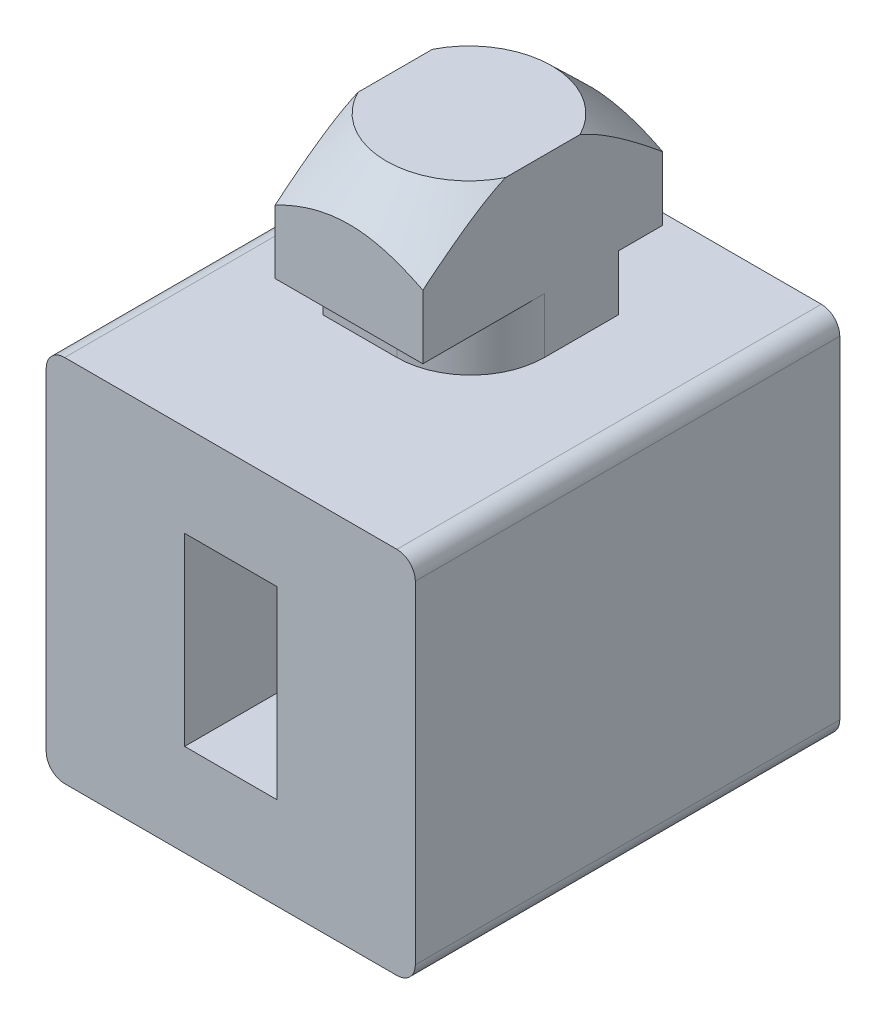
ISO-10303-21;
HEADER;
FILE_DESCRIPTION(('STEP AP214'),'2;1');
FILE_NAME('part.step','',(''),(''),'','','');
FILE_SCHEMA(('AUTOMOTIVE_DESIGN { 1 0 10303 214 1 1 1 1 }'));
ENDSEC;
DATA;
#1=APPLICATION_CONTEXT('core data for automotive mechanical design processes');
#2=APPLICATION_PROTOCOL_DEFINITION('international standard','automotive_design',2000,#1);
#3=PRODUCT_CONTEXT('',#1,'mechanical');
#4=PRODUCT('Part','Part','',(#3));
#5=PRODUCT_RELATED_PRODUCT_CATEGORY('part','',(#4));
#6=PRODUCT_DEFINITION_FORMATION('','',#4);
#7=PRODUCT_DEFINITION_CONTEXT('part definition',#1,'design');
#8=PRODUCT_DEFINITION('design','',#6,#7);
#9=PRODUCT_DEFINITION_SHAPE('','',#8);
#10=(LENGTH_UNIT() NAMED_UNIT(*) SI_UNIT(.MILLI.,.METRE.));
#11=(NAMED_UNIT(*) PLANE_ANGLE_UNIT() SI_UNIT($,.RADIAN.));
#12=(NAMED_UNIT(*) SI_UNIT($,.STERADIAN.) SOLID_ANGLE_UNIT());
#13=UNCERTAINTY_MEASURE_WITH_UNIT(LENGTH_MEASURE(1.E-05),#10,'distance_accuracy_value','');
#14=(GEOMETRIC_REPRESENTATION_CONTEXT(3) GLOBAL_UNCERTAINTY_ASSIGNED_CONTEXT((#13)) GLOBAL_UNIT_ASSIGNED_CONTEXT((#10,
#11,#12)) REPRESENTATION_CONTEXT('',''));
#15=CARTESIAN_POINT('',(0.,0.,0.));
#16=DIRECTION('',(0.,0.,1.));
#17=DIRECTION('',(1.,0.,0.));
#18=AXIS2_PLACEMENT_3D('',#15,#16,#17);
#19=CARTESIAN_POINT('',(4.,13.,-5.5));
#20=DIRECTION('',(-1.,0.,0.));
#21=DIRECTION('',(0.,0.,1.));
#22=AXIS2_PLACEMENT_3D('',#19,#20,#21);
#23=PLANE('',#22);
#24=CARTESIAN_POINT('',(4.,9.28382163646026,13.1107658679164));
#25=CARTESIAN_POINT('',(4.,9.56517541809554,12.8085453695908));
#26=CARTESIAN_POINT('',(4.,9.84621093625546,12.5060277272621));
#27=CARTESIAN_POINT('',(4.,10.4074796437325,11.9002440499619));
#28=CARTESIAN_POINT('',(4.,10.6877128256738,11.5969780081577));
#29=CARTESIAN_POINT('',(4.,11.2473012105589,10.9894454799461));
#30=CARTESIAN_POINT('',(4.,11.5266560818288,10.685178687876));
#31=CARTESIAN_POINT('',(4.,12.0841550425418,10.0755394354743));
#32=CARTESIAN_POINT('',(4.,12.3622991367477,9.7701669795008));
#33=CARTESIAN_POINT('',(4.,12.9127544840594,9.16279452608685));
#34=CARTESIAN_POINT('',(4.,13.1850892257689,8.86081583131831));
#35=CARTESIAN_POINT('',(4.,13.7278680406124,8.25516450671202));
#36=CARTESIAN_POINT('',(4.,13.9983121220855,7.95149188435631));
#37=CARTESIAN_POINT('',(4.,14.5366882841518,7.34200416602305));
#38=CARTESIAN_POINT('',(4.,14.804620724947,7.03618938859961));
#39=CARTESIAN_POINT('',(4.,15.3371673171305,6.42168781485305));
#40=CARTESIAN_POINT('',(4.,15.6017815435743,6.11300108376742));
#41=CARTESIAN_POINT('',(4.,16.0567574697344,5.57419674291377));
#42=CARTESIAN_POINT('',(4.,16.2481814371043,5.34497721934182));
#43=CARTESIAN_POINT('',(4.,16.6277944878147,4.88383214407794));
#44=CARTESIAN_POINT('',(4.,16.8159832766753,4.65190634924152));
#45=CARTESIAN_POINT('',(4.,17.1897133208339,4.18245027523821));
#46=CARTESIAN_POINT('',(4.,17.3752146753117,3.94488815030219));
#47=CARTESIAN_POINT('',(4.,17.7400913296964,3.46515310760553));
#48=CARTESIAN_POINT('',(4.,17.9194680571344,3.22298128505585));
#49=CARTESIAN_POINT('',(4.,18.1831251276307,2.85340282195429));
#50=CARTESIAN_POINT('',(4.,18.270661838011,2.72832026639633));
#51=CARTESIAN_POINT('',(4.,18.4429783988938,2.47627405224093));
#52=CARTESIAN_POINT('',(4.,18.5277583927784,2.34931049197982));
#53=CARTESIAN_POINT('',(4.,18.6940562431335,2.09300222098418));
#54=CARTESIAN_POINT('',(4.,18.7755693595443,1.96365442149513));
#55=CARTESIAN_POINT('',(4.,18.9343737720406,1.70240290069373));
#56=CARTESIAN_POINT('',(4.,19.0116654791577,1.57049942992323));
#57=CARTESIAN_POINT('',(4.,19.1601922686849,1.30509396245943));
#58=CARTESIAN_POINT('',(4.,19.2314821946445,1.17162306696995));
#59=CARTESIAN_POINT('',(4.,19.3675261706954,0.901408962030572));
#60=CARTESIAN_POINT('',(4.,19.4322790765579,0.764665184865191));
#61=CARTESIAN_POINT('',(4.,19.61391236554,0.349570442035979));
#62=CARTESIAN_POINT('',(4.,19.7186951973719,0.0654576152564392));
#63=CARTESIAN_POINT('',(4.,19.8363194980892,-0.364497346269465));
#64=CARTESIAN_POINT('',(4.,19.8685975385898,-0.505053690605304));
#65=CARTESIAN_POINT('',(4.,19.9197331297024,-0.788632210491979));
#66=CARTESIAN_POINT('',(4.,19.938592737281,-0.931654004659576));
#67=CARTESIAN_POINT('',(4.,19.9614831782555,-1.21829893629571));
#68=CARTESIAN_POINT('',(4.,19.9655756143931,-1.36191706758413));
#69=CARTESIAN_POINT('',(4.,19.9587830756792,-1.64880420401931));
#70=CARTESIAN_POINT('',(4.,19.9478968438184,-1.79207317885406));
#71=CARTESIAN_POINT('',(4.,19.9121174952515,-2.07566712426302));
#72=CARTESIAN_POINT('',(4.,19.8873351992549,-2.2160063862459));
#73=CARTESIAN_POINT('',(4.,19.8254685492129,-2.49391456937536));
#74=CARTESIAN_POINT('',(4.,19.7883824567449,-2.63148309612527));
#75=CARTESIAN_POINT('',(4.,19.7035749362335,-2.90428072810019));
#76=CARTESIAN_POINT('',(4.,19.6557834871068,-3.03948780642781));
#77=CARTESIAN_POINT('',(4.,19.5776893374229,-3.23973632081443));
#78=CARTESIAN_POINT('',(4.,19.5505913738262,-3.30605612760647));
#79=CARTESIAN_POINT('',(4.,19.4944702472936,-3.43787440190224));
#80=CARTESIAN_POINT('',(4.,19.4654471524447,-3.50337289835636));
#81=CARTESIAN_POINT('',(4.,19.3741231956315,-3.70231982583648));
#82=CARTESIAN_POINT('',(4.,19.309041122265,-3.83449517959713));
#83=CARTESIAN_POINT('',(4.,19.173072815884,-4.09584246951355));
#84=CARTESIAN_POINT('',(4.,19.102184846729,-4.22501349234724));
#85=CARTESIAN_POINT('',(4.,18.9556943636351,-4.48083577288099));
#86=CARTESIAN_POINT('',(4.,18.8800866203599,-4.60748402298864));
#87=CARTESIAN_POINT('',(4.,18.7251424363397,-4.85845097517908));
#88=CARTESIAN_POINT('',(4.,18.6458063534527,-4.98276989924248));
#89=CARTESIAN_POINT('',(4.,18.4837707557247,-5.2299137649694));
#90=CARTESIAN_POINT('',(4.,18.4010588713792,-5.35273057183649));
#91=CARTESIAN_POINT('',(4.,18.2331201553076,-5.59663565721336));
#92=CARTESIAN_POINT('',(4.,18.147893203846,-5.71772385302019));
#93=CARTESIAN_POINT('',(4.,17.8892192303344,-6.07861404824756));
#94=CARTESIAN_POINT('',(4.,17.7126760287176,-6.31619639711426));
#95=CARTESIAN_POINT('',(4.,17.3517239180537,-6.78965203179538));
#96=CARTESIAN_POINT('',(4.,17.167247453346,-7.0254733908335));
#97=CARTESIAN_POINT('',(4.,16.7939537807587,-7.49369270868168));
#98=CARTESIAN_POINT('',(4.,16.6051360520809,-7.72609025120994));
#99=CARTESIAN_POINT('',(4.,16.2247395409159,-8.18764523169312));
#100=CARTESIAN_POINT('',(4.,16.0331687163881,-8.41680924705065));
#101=CARTESIAN_POINT('',(4.,15.6475534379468,-8.87304834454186));
#102=CARTESIAN_POINT('',(4.,15.4535089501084,-9.10012339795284));
#103=CARTESIAN_POINT('',(4.,15.0127020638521,-9.61152042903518));
#104=CARTESIAN_POINT('',(4.,14.7653703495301,-9.89535117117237));
#105=CARTESIAN_POINT('',(4.,14.2683885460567,-10.4609793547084));
#106=CARTESIAN_POINT('',(4.,14.0187384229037,-10.7427767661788));
#107=CARTESIAN_POINT('',(4.,13.5174329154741,-11.3050098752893));
#108=CARTESIAN_POINT('',(4.,13.2657760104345,-11.5854442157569));
#109=CARTESIAN_POINT('',(4.,12.7610448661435,-12.1450343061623));
#110=CARTESIAN_POINT('',(4.,12.5079706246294,-12.4241900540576));
#111=CARTESIAN_POINT('',(4.,12.0083559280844,-12.9730370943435));
#112=CARTESIAN_POINT('',(4.,11.7618493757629,-13.2427592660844));
#113=CARTESIAN_POINT('',(4.,11.2679575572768,-13.7813986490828));
#114=CARTESIAN_POINT('',(4.,11.0205722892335,-14.0503158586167));
#115=CARTESIAN_POINT('',(4.,10.5253074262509,-14.5872256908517));
#116=CARTESIAN_POINT('',(4.,10.2774285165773,-14.8552189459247));
#117=CARTESIAN_POINT('',(4.,9.78105741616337,-15.390634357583));
#118=CARTESIAN_POINT('',(4.,9.53256522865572,-15.6580565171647));
#119=CARTESIAN_POINT('',(4.,9.28382163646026,-15.9252441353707));
#120=B_SPLINE_CURVE_WITH_KNOTS('',3,(#24,#25,#26,#27,#28,#29,#30,#31,#32,#33,#34,#35,#36,#37,
#38,#39,#40,#41,#42,#43,#44,#45,#46,#47,#48,#49,#50,#51,#52,#53,#54,#55,#56,#57,#58,#59,#60,#61,
#62,#63,#64,#65,#66,#67,#68,#69,#70,#71,#72,#73,#74,#75,#76,#77,#78,#79,#80,#81,#82,#83,#84,#85,
#86,#87,#88,#89,#90,#91,#92,#93,#94,#95,#96,#97,#98,#99,#100,#101,#102,#103,#104,#105,#106,#107,
#108,#109,#110,#111,#112,#113,#114,#115,#116,#117,#118,#119),.UNSPECIFIED.,.F.,.F.,(4,2,2,2,2,2,
2,2,2,2,2,2,2,2,2,2,2,2,2,2,2,2,2,2,2,2,2,2,2,2,2,2,2,2,2,2,2,2,2,2,2,2,2,2,2,2,2,4),(0.,
1.23873983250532,2.47749101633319,3.71666426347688,4.9558326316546,6.17575125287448,
7.39566448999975,8.61540001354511,9.83510789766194,10.7310007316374,11.6269746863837,
12.531135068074,13.4350832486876,13.8930666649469,14.3510262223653,14.8096278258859,
15.2681846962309,15.7219504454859,16.1757954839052,17.0803715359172,17.5124911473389,
17.9445445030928,18.3747934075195,18.8050784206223,19.2319797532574,19.6589414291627,
20.0887818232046,20.3036843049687,20.5185791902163,20.9603678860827,21.402289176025,
21.8447091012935,22.2870866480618,22.7312637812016,23.1754620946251,24.0633013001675,
24.9614557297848,25.8597184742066,26.7557658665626,27.6518255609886,28.7812308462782,
29.910652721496,31.0410322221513,32.1714135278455,33.2676045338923,34.3637978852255,
35.4589585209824,36.5541133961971),.UNSPECIFIED.);
#121=CARTESIAN_POINT('',(4.,16.455796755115,5.09276086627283));
#122=VERTEX_POINT('',#121);
#123=CARTESIAN_POINT('',(4.,19.5,0.609848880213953));
#124=VERTEX_POINT('',#123);
#125=EDGE_CURVE('E253',#122,#124,#120,.T.);
#126=ORIENTED_EDGE('',*,*,#125,.F.);
#127=DIRECTION('',(0.,-1.,0.));
#128=VECTOR('',#127,1.);
#129=CARTESIAN_POINT('',(4.,19.5,5.09276086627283));
#130=LINE('',#129,#128);
#131=CARTESIAN_POINT('',(4.,13.,5.09276086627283));
#132=VERTEX_POINT('',#131);
#133=EDGE_CURVE('E274',#122,#132,#130,.T.);
#134=ORIENTED_EDGE('',*,*,#133,.T.);
#135=DIRECTION('',(0.,0.,-1.));
#136=VECTOR('',#135,1.);
#137=CARTESIAN_POINT('',(4.,13.,-7.90723913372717));
#138=LINE('',#137,#136);
#139=CARTESIAN_POINT('',(4.,13.,-1.5));
#140=VERTEX_POINT('',#139);
#141=EDGE_CURVE('E291',#132,#140,#138,.T.);
#142=ORIENTED_EDGE('',*,*,#141,.T.);
#143=DIRECTION('',(0.,-1.,0.));
#144=VECTOR('',#143,1.);
#145=CARTESIAN_POINT('',(4.,13.,-1.5));
#146=LINE('',#145,#144);
#147=CARTESIAN_POINT('',(4.,9.99999999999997,-1.5));
#148=VERTEX_POINT('',#147);
#149=EDGE_CURVE('E372',#140,#148,#146,.T.);
#150=ORIENTED_EDGE('',*,*,#149,.T.);
#151=DIRECTION('',(0.,0.,-1.));
#152=VECTOR('',#151,1.);
#153=CARTESIAN_POINT('',(4.,9.99999999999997,-5.5));
#154=LINE('',#153,#152);
#155=CARTESIAN_POINT('',(4.,9.99999999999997,-5.5));
#156=VERTEX_POINT('',#155);
#157=EDGE_CURVE('E353',#148,#156,#154,.T.);
#158=ORIENTED_EDGE('',*,*,#157,.T.);
#159=DIRECTION('',(0.,-1.,0.));
#160=VECTOR('',#159,1.);
#161=CARTESIAN_POINT('',(4.,13.,-5.5));
#162=LINE('',#161,#160);
#163=CARTESIAN_POINT('',(4.,13.,-5.5));
#164=VERTEX_POINT('',#163);
#165=EDGE_CURVE('E343',#164,#156,#162,.T.);
#166=ORIENTED_EDGE('',*,*,#165,.F.);
#167=CARTESIAN_POINT('',(4.,13.,-7.90723913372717));
#168=VERTEX_POINT('',#167);
#169=EDGE_CURVE('E288',#164,#168,#138,.T.);
#170=ORIENTED_EDGE('',*,*,#169,.T.);
#171=DIRECTION('',(0.,-1.,0.));
#172=VECTOR('',#171,1.);
#173=CARTESIAN_POINT('',(4.,19.5,-7.90723913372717));
#174=LINE('',#173,#172);
#175=CARTESIAN_POINT('',(4.,16.455796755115,-7.90723913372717));
#176=VERTEX_POINT('',#175);
#177=EDGE_CURVE('E294',#176,#168,#174,.T.);
#178=ORIENTED_EDGE('',*,*,#177,.F.);
#179=CARTESIAN_POINT('',(4.,19.5,-3.4243271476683));
#180=VERTEX_POINT('',#179);
#181=EDGE_CURVE('E497',#180,#176,#120,.T.);
#182=ORIENTED_EDGE('',*,*,#181,.F.);
#183=DIRECTION('',(0.,0.,-1.));
#184=VECTOR('',#183,1.);
#185=CARTESIAN_POINT('',(4.,19.5,-7.90723913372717));
#186=LINE('',#185,#184);
#187=EDGE_CURVE('E275',#124,#180,#186,.T.);
#188=ORIENTED_EDGE('',*,*,#187,.F.);
#189=EDGE_LOOP('',(#126,#134,#142,#150,#158,#166,#170,#178,#182,#188));
#190=FACE_BOUND('',#189,.T.);
#191=ADVANCED_FACE('F37',(#190),#23,.F.);
#192=CARTESIAN_POINT('',(-4.,13.,-1.5));
#193=DIRECTION('',(1.,0.,0.));
#194=DIRECTION('',(0.,0.,-1.));
#195=AXIS2_PLACEMENT_3D('',#192,#193,#194);
#196=PLANE('',#195);
#197=CARTESIAN_POINT('',(-4.00000000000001,9.28382163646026,-15.9252441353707));
#198=CARTESIAN_POINT('',(-4.,9.56517541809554,-15.6230236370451));
#199=CARTESIAN_POINT('',(-4.,9.84621093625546,-15.3205059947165));
#200=CARTESIAN_POINT('',(-4.,10.4074796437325,-14.7147223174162));
#201=CARTESIAN_POINT('',(-4.,10.6877128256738,-14.4114562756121));
#202=CARTESIAN_POINT('',(-4.,11.2473012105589,-13.8039237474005));
#203=CARTESIAN_POINT('',(-4.,11.5266560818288,-13.4996569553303));
#204=CARTESIAN_POINT('',(-4.,12.0841550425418,-12.8900177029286));
#205=CARTESIAN_POINT('',(-4.,12.3622991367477,-12.5846452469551));
#206=CARTESIAN_POINT('',(-4.,12.9127544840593,-11.9772727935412));
#207=CARTESIAN_POINT('',(-4.,13.1850892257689,-11.6752940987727));
#208=CARTESIAN_POINT('',(-4.,13.7278680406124,-11.0696427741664));
#209=CARTESIAN_POINT('',(-4.,13.9983121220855,-10.7659701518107));
#210=CARTESIAN_POINT('',(-4.,14.5366882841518,-10.1564824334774));
#211=CARTESIAN_POINT('',(-4.,14.804620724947,-9.85066765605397));
#212=CARTESIAN_POINT('',(-4.,15.3371673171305,-9.2361660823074));
#213=CARTESIAN_POINT('',(-4.,15.6017815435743,-8.92747935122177));
#214=CARTESIAN_POINT('',(-4.,16.0567574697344,-8.38867501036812));
#215=CARTESIAN_POINT('',(-4.,16.2481814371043,-8.15945548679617));
#216=CARTESIAN_POINT('',(-4.,16.6277944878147,-7.69831041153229));
#217=CARTESIAN_POINT('',(-4.,16.8159832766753,-7.46638461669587));
#218=CARTESIAN_POINT('',(-4.,17.1897133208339,-6.99692854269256));
#219=CARTESIAN_POINT('',(-4.,17.3752146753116,-6.75936641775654));
#220=CARTESIAN_POINT('',(-4.,17.7400913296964,-6.27963137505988));
#221=CARTESIAN_POINT('',(-4.,17.9194680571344,-6.03745955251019));
#222=CARTESIAN_POINT('',(-4.,18.1831251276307,-5.66788108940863));
#223=CARTESIAN_POINT('',(-4.,18.270661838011,-5.54279853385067));
#224=CARTESIAN_POINT('',(-4.,18.4429783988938,-5.29075231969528));
#225=CARTESIAN_POINT('',(-4.,18.5277583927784,-5.16378875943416));
#226=CARTESIAN_POINT('',(-4.,18.6940562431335,-4.90748048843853));
#227=CARTESIAN_POINT('',(-4.,18.7755693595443,-4.77813268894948));
#228=CARTESIAN_POINT('',(-4.,18.9343737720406,-4.51688116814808));
#229=CARTESIAN_POINT('',(-4.,19.0116654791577,-4.38497769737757));
#230=CARTESIAN_POINT('',(-4.,19.1601922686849,-4.11957222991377));
#231=CARTESIAN_POINT('',(-4.,19.2314821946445,-3.98610133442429));
#232=CARTESIAN_POINT('',(-4.,19.3675261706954,-3.71588722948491));
#233=CARTESIAN_POINT('',(-4.,19.4322790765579,-3.57914345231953));
#234=CARTESIAN_POINT('',(-4.,19.61391236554,-3.16404870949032));
#235=CARTESIAN_POINT('',(-4.,19.7186951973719,-2.87993588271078));
#236=CARTESIAN_POINT('',(-4.,19.8363194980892,-2.44998092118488));
#237=CARTESIAN_POINT('',(-4.,19.8685975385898,-2.30942457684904));
#238=CARTESIAN_POINT('',(-4.,19.9197331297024,-2.02584605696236));
#239=CARTESIAN_POINT('',(-4.,19.938592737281,-1.88282426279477));
#240=CARTESIAN_POINT('',(-4.,19.9614831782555,-1.59617933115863));
#241=CARTESIAN_POINT('',(-4.,19.9655756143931,-1.45256119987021));
#242=CARTESIAN_POINT('',(-4.,19.9587830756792,-1.16567406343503));
#243=CARTESIAN_POINT('',(-4.,19.9478968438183,-1.02240508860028));
#244=CARTESIAN_POINT('',(-4.,19.9121174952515,-0.738811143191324));
#245=CARTESIAN_POINT('',(-4.,19.8873351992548,-0.598471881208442));
#246=CARTESIAN_POINT('',(-4.,19.8254685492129,-0.320563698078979));
#247=CARTESIAN_POINT('',(-4.,19.7883824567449,-0.182995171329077));
#248=CARTESIAN_POINT('',(-4.,19.7035749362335,0.0898024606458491));
#249=CARTESIAN_POINT('',(-4.,19.6557834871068,0.225009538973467));
#250=CARTESIAN_POINT('',(-4.,19.5776893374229,0.425258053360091));
#251=CARTESIAN_POINT('',(-4.,19.5505913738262,0.491577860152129));
#252=CARTESIAN_POINT('',(-4.,19.4944702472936,0.623396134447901));
#253=CARTESIAN_POINT('',(-4.,19.4654471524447,0.688894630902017));
#254=CARTESIAN_POINT('',(-4.,19.3741231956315,0.887841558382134));
#255=CARTESIAN_POINT('',(-4.,19.309041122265,1.02001691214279));
#256=CARTESIAN_POINT('',(-4.,19.173072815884,1.2813642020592));
#257=CARTESIAN_POINT('',(-4.,19.102184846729,1.4105352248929));
#258=CARTESIAN_POINT('',(-4.,18.9556943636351,1.66635750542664));
#259=CARTESIAN_POINT('',(-4.,18.8800866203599,1.79300575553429));
#260=CARTESIAN_POINT('',(-4.,18.7251424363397,2.04397270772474));
#261=CARTESIAN_POINT('',(-4.,18.6458063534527,2.16829163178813));
#262=CARTESIAN_POINT('',(-4.,18.4837707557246,2.41543549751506));
#263=CARTESIAN_POINT('',(-4.,18.4010588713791,2.53825230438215));
#264=CARTESIAN_POINT('',(-4.,18.2331201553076,2.78215738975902));
#265=CARTESIAN_POINT('',(-4.,18.147893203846,2.90324558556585));
#266=CARTESIAN_POINT('',(-4.,17.8892192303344,3.26413578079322));
#267=CARTESIAN_POINT('',(-4.,17.7126760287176,3.50171812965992));
#268=CARTESIAN_POINT('',(-4.,17.3517239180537,3.97517376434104));
#269=CARTESIAN_POINT('',(-4.,17.167247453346,4.21099512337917));
#270=CARTESIAN_POINT('',(-4.,16.7939537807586,4.67921444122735));
#271=CARTESIAN_POINT('',(-4.,16.6051360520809,4.91161198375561));
#272=CARTESIAN_POINT('',(-4.,16.2247395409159,5.37316696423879));
#273=CARTESIAN_POINT('',(-4.,16.0331687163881,5.60233097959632));
#274=CARTESIAN_POINT('',(-4.,15.6475534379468,6.05857007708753));
#275=CARTESIAN_POINT('',(-4.,15.4535089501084,6.28564513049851));
#276=CARTESIAN_POINT('',(-4.,15.0127020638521,6.79704216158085));
#277=CARTESIAN_POINT('',(-4.,14.7653703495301,7.08087290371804));
#278=CARTESIAN_POINT('',(-4.,14.2683885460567,7.64650108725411));
#279=CARTESIAN_POINT('',(-4.,14.0187384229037,7.92829849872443));
#280=CARTESIAN_POINT('',(-4.,13.5174329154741,8.49053160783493));
#281=CARTESIAN_POINT('',(-4.,13.2657760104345,8.77096594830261));
#282=CARTESIAN_POINT('',(-4.,12.7610448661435,9.33055603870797));
#283=CARTESIAN_POINT('',(-4.,12.5079706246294,9.60971178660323));
#284=CARTESIAN_POINT('',(-4.,12.0083559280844,10.1585588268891));
#285=CARTESIAN_POINT('',(-4.,11.7618493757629,10.4282809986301));
#286=CARTESIAN_POINT('',(-4.,11.2679575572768,10.9669203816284));
#287=CARTESIAN_POINT('',(-4.,11.0205722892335,11.2358375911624));
#288=CARTESIAN_POINT('',(-4.,10.5253074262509,11.7727474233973));
#289=CARTESIAN_POINT('',(-4.,10.2774285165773,12.0407406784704));
#290=CARTESIAN_POINT('',(-4.,9.78105741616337,12.5761560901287));
#291=CARTESIAN_POINT('',(-4.,9.53256522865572,12.8435782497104));
#292=CARTESIAN_POINT('',(-4.,9.28382163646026,13.1107658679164));
#293=B_SPLINE_CURVE_WITH_KNOTS('',3,(#197,#198,#199,#200,#201,#202,#203,#204,#205,#206,#207,
#208,#209,#210,#211,#212,#213,#214,#215,#216,#217,#218,#219,#220,#221,#222,#223,#224,#225,#226,
#227,#228,#229,#230,#231,#232,#233,#234,#235,#236,#237,#238,#239,#240,#241,#242,#243,#244,#245,
#246,#247,#248,#249,#250,#251,#252,#253,#254,#255,#256,#257,#258,#259,#260,#261,#262,#263,#264,
#265,#266,#267,#268,#269,#270,#271,#272,#273,#274,#275,#276,#277,#278,#279,#280,#281,#282,#283,
#284,#285,#286,#287,#288,#289,#290,#291,#292),.UNSPECIFIED.,.F.,.F.,(4,2,2,2,2,2,2,2,2,2,2,2,2,
2,2,2,2,2,2,2,2,2,2,2,2,2,2,2,2,2,2,2,2,2,2,2,2,2,2,2,2,2,2,2,2,2,2,4),(0.,1.23873983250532,
2.47749101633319,3.71666426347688,4.95583263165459,6.17575125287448,7.39566448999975,
8.6154000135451,9.83510789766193,10.7310007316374,11.6269746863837,12.531135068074,
13.4350832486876,13.8930666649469,14.3510262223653,14.8096278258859,15.2681846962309,
15.7219504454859,16.1757954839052,17.0803715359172,17.5124911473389,17.9445445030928,
18.3747934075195,18.8050784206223,19.2319797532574,19.6589414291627,20.0887818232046,
20.3036843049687,20.5185791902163,20.9603678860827,21.402289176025,21.8447091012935,
22.2870866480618,22.7312637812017,23.1754620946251,24.0633013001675,24.9614557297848,
25.8597184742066,26.7557658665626,27.6518255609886,28.7812308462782,29.910652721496,
31.0410322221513,32.1714135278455,33.2676045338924,34.3637978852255,35.4589585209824,
36.5541133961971),.UNSPECIFIED.);
#294=CARTESIAN_POINT('',(-4.,16.455796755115,-7.90723913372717));
#295=VERTEX_POINT('',#294);
#296=CARTESIAN_POINT('',(-4.,19.5,-3.42432714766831));
#297=VERTEX_POINT('',#296);
#298=EDGE_CURVE('E271',#295,#297,#293,.T.);
#299=ORIENTED_EDGE('',*,*,#298,.F.);
#300=DIRECTION('',(0.,-1.,0.));
#301=VECTOR('',#300,1.);
#302=CARTESIAN_POINT('',(-4.,19.5,-7.90723913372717));
#303=LINE('',#302,#301);
#304=CARTESIAN_POINT('',(-4.,13.,-7.90723913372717));
#305=VERTEX_POINT('',#304);
#306=EDGE_CURVE('E297',#295,#305,#303,.T.);
#307=ORIENTED_EDGE('',*,*,#306,.T.);
#308=DIRECTION('',(0.,0.,1.));
#309=VECTOR('',#308,1.);
#310=CARTESIAN_POINT('',(-4.,13.,-7.90723913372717));
#311=LINE('',#310,#309);
#312=CARTESIAN_POINT('',(-4.,13.,-1.5));
#313=VERTEX_POINT('',#312);
#314=EDGE_CURVE('E301',#305,#313,#311,.T.);
#315=ORIENTED_EDGE('',*,*,#314,.T.);
#316=DIRECTION('',(0.,-1.,0.));
#317=VECTOR('',#316,1.);
#318=CARTESIAN_POINT('',(-4.,13.,-1.5));
#319=LINE('',#318,#317);
#320=CARTESIAN_POINT('',(-4.,9.99999999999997,-1.5));
#321=VERTEX_POINT('',#320);
#322=EDGE_CURVE('E334',#313,#321,#319,.T.);
#323=ORIENTED_EDGE('',*,*,#322,.T.);
#324=DIRECTION('',(0.,0.,1.));
#325=VECTOR('',#324,1.);
#326=CARTESIAN_POINT('',(-4.,9.99999999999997,-1.5));
#327=LINE('',#326,#325);
#328=CARTESIAN_POINT('',(-4.,9.99999999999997,2.5));
#329=VERTEX_POINT('',#328);
#330=EDGE_CURVE('E362',#321,#329,#327,.T.);
#331=ORIENTED_EDGE('',*,*,#330,.T.);
#332=DIRECTION('',(0.,-1.,0.));
#333=VECTOR('',#332,1.);
#334=CARTESIAN_POINT('',(-4.,13.,2.5));
#335=LINE('',#334,#333);
#336=CARTESIAN_POINT('',(-4.,13.,2.5));
#337=VERTEX_POINT('',#336);
#338=EDGE_CURVE('E331',#337,#329,#335,.T.);
#339=ORIENTED_EDGE('',*,*,#338,.F.);
#340=CARTESIAN_POINT('',(-4.,13.,5.09276086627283));
#341=VERTEX_POINT('',#340);
#342=EDGE_CURVE('E305',#337,#341,#311,.T.);
#343=ORIENTED_EDGE('',*,*,#342,.T.);
#344=DIRECTION('',(0.,-1.,0.));
#345=VECTOR('',#344,1.);
#346=CARTESIAN_POINT('',(-4.,19.5,5.09276086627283));
#347=LINE('',#346,#345);
#348=CARTESIAN_POINT('',(-4.,16.455796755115,5.09276086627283));
#349=VERTEX_POINT('',#348);
#350=EDGE_CURVE('E268',#349,#341,#347,.T.);
#351=ORIENTED_EDGE('',*,*,#350,.F.);
#352=CARTESIAN_POINT('',(-4.,19.5,0.609848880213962));
#353=VERTEX_POINT('',#352);
#354=EDGE_CURVE('E250',#353,#349,#293,.T.);
#355=ORIENTED_EDGE('',*,*,#354,.F.);
#356=DIRECTION('',(0.,0.,1.));
#357=VECTOR('',#356,1.);
#358=CARTESIAN_POINT('',(-4.,19.5,-7.90723913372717));
#359=LINE('',#358,#357);
#360=EDGE_CURVE('E266',#297,#353,#359,.T.);
#361=ORIENTED_EDGE('',*,*,#360,.F.);
#362=EDGE_LOOP('',(#299,#307,#315,#323,#331,#339,#343,#351,#355,#361));
#363=FACE_BOUND('',#362,.T.);
#364=ADVANCED_FACE('F265',(#363),#196,.F.);
#365=CARTESIAN_POINT('',(-4.,19.5,-7.90723913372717));
#366=DIRECTION('',(0.,0.,1.));
#367=DIRECTION('',(1.,0.,0.));
#368=AXIS2_PLACEMENT_3D('',#365,#366,#367);
#369=PLANE('',#368);
#370=CARTESIAN_POINT('',(-7.57729543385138,14.1853779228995,-7.90723913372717));
#371=CARTESIAN_POINT('',(-7.39078297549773,14.3220523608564,-7.90723913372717));
#372=CARTESIAN_POINT('',(-7.20326870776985,14.4573820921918,-7.90723913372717));
#373=CARTESIAN_POINT('',(-6.82583780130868,14.7247455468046,-7.90723913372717));
#374=CARTESIAN_POINT('',(-6.63592057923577,14.8567784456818,-7.90723913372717));
#375=CARTESIAN_POINT('',(-6.25192523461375,15.1178604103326,-7.90723913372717));
#376=CARTESIAN_POINT('',(-6.05782647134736,15.246879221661,-7.90723913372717));
#377=CARTESIAN_POINT('',(-5.66645803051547,15.4999987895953,-7.90723913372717));
#378=CARTESIAN_POINT('',(-5.46918857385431,15.6240998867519,-7.90723913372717));
#379=CARTESIAN_POINT('',(-5.06002071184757,15.8729488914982,-7.90723913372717));
#380=CARTESIAN_POINT('',(-4.84791450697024,15.997356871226,-7.90723913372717));
#381=CARTESIAN_POINT('',(-4.41894362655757,16.2378133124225,-7.90723913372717));
#382=CARTESIAN_POINT('',(-4.20207823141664,16.3538604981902,-7.90723913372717));
#383=CARTESIAN_POINT('',(-3.76362583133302,16.5750636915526,-7.90723913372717));
#384=CARTESIAN_POINT('',(-3.54205471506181,16.6802509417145,-7.90723913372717));
#385=CARTESIAN_POINT('',(-3.09312484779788,16.877331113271,-7.90723913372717));
#386=CARTESIAN_POINT('',(-2.86576867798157,16.9692298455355,-7.90723913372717));
#387=CARTESIAN_POINT('',(-2.41936260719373,17.1311998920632,-7.90723913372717));
#388=CARTESIAN_POINT('',(-2.2006815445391,17.2022763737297,-7.90723913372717));
#389=CARTESIAN_POINT('',(-1.75824779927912,17.3267382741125,-7.90723913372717));
#390=CARTESIAN_POINT('',(-1.53449486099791,17.3801227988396,-7.90723913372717));
#391=CARTESIAN_POINT('',(-1.08699783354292,17.4654127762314,-7.90723913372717));
#392=CARTESIAN_POINT('',(-0.863324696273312,17.4976841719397,-7.90723913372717));
#393=CARTESIAN_POINT('',(-0.413879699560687,17.540112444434,-7.90723913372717));
#394=CARTESIAN_POINT('',(-0.188108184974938,17.5502728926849,-7.90723913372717));
#395=CARTESIAN_POINT('',(0.253876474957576,17.5478084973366,-7.90723913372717));
#396=CARTESIAN_POINT('',(0.470095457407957,17.5361164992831,-7.90723913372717));
#397=CARTESIAN_POINT('',(0.900474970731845,17.4925454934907,-7.90723913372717));
#398=CARTESIAN_POINT('',(1.11463529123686,17.460664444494,-7.90723913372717));
#399=CARTESIAN_POINT('',(1.5431501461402,17.3778970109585,-7.90723913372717));
#400=CARTESIAN_POINT('',(1.75744027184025,17.3266824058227,-7.90723913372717));
#401=CARTESIAN_POINT('',(2.18136784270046,17.2079797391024,-7.90723913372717));
#402=CARTESIAN_POINT('',(2.39100577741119,17.1404933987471,-7.90723913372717));
#403=CARTESIAN_POINT('',(2.84180965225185,16.9789158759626,-7.90723913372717));
#404=CARTESIAN_POINT('',(3.08203870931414,16.8822332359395,-7.90723913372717));
#405=CARTESIAN_POINT('',(3.55605546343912,16.674069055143,-7.90723913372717));
#406=CARTESIAN_POINT('',(3.78983965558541,16.5625796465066,-7.90723913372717));
#407=CARTESIAN_POINT('',(4.25229608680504,16.3276476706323,-7.90723913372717));
#408=CARTESIAN_POINT('',(4.48094772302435,16.2041648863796,-7.90723913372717));
#409=CARTESIAN_POINT('',(4.93301514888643,15.9481156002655,-7.90723913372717));
#410=CARTESIAN_POINT('',(5.15643189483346,15.8155507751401,-7.90723913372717));
#411=CARTESIAN_POINT('',(5.58667026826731,15.5507037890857,-7.90723913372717));
#412=CARTESIAN_POINT('',(5.79372958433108,15.4188056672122,-7.90723913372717));
#413=CARTESIAN_POINT('',(6.20444928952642,15.1498015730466,-7.90723913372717));
#414=CARTESIAN_POINT('',(6.40810941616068,15.012695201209,-7.90723913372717));
#415=CARTESIAN_POINT('',(6.81076811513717,14.7354423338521,-7.90723913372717));
#416=CARTESIAN_POINT('',(7.00979169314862,14.5953320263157,-7.90723913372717));
#417=CARTESIAN_POINT('',(7.4053003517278,14.3116781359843,-7.90723913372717));
#418=CARTESIAN_POINT('',(7.60178608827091,14.1681354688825,-7.90723913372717));
#419=CARTESIAN_POINT('',(7.79722416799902,14.0232040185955,-7.90723913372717));
#420=B_SPLINE_CURVE_WITH_KNOTS('',3,(#370,#371,#372,#373,#374,#375,#376,#377,#378,#379,#380,
#381,#382,#383,#384,#385,#386,#387,#388,#389,#390,#391,#392,#393,#394,#395,#396,#397,#398,#399,
#400,#401,#402,#403,#404,#405,#406,#407,#408,#409,#410,#411,#412,#413,#414,#415,#416,#417,#418,
#419),.UNSPECIFIED.,.F.,.F.,(4,2,2,2,2,2,2,2,2,2,2,2,2,2,2,2,2,2,2,2,2,2,2,2,4),(0.,
0.693700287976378,1.38757233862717,2.08671101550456,2.78580119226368,3.52334652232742,
4.26100415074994,4.99647676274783,5.73162678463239,6.42083467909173,7.11007739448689,
7.78703293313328,8.46387911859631,9.11248950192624,9.76116547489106,10.4213888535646,
11.0815424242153,11.8577590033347,12.6343897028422,13.4137210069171,14.1929088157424,
14.9293189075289,15.6657856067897,16.395931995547,17.1258857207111),.UNSPECIFIED.);
#421=EDGE_CURVE('E496',#176,#295,#420,.F.);
#422=ORIENTED_EDGE('',*,*,#421,.F.);
#423=ORIENTED_EDGE('',*,*,#177,.T.);
#424=DIRECTION('',(-1.,0.,0.));
#425=VECTOR('',#424,1.);
#426=CARTESIAN_POINT('',(-4.,13.,-7.90723913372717));
#427=LINE('',#426,#425);
#428=EDGE_CURVE('E284',#168,#305,#427,.T.);
#429=ORIENTED_EDGE('',*,*,#428,.T.);
#430=ORIENTED_EDGE('',*,*,#306,.F.);
#431=EDGE_LOOP('',(#422,#423,#429,#430));
#432=FACE_BOUND('',#431,.T.);
#433=ADVANCED_FACE('F317',(#432),#369,.F.);
#434=CARTESIAN_POINT('',(-4.,19.5,5.09276086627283));
#435=DIRECTION('',(0.,0.,-1.));
#436=DIRECTION('',(-1.,0.,0.));
#437=AXIS2_PLACEMENT_3D('',#434,#435,#436);
#438=PLANE('',#437);
#439=CARTESIAN_POINT('',(-7.57729543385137,14.1853779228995,5.09276086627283));
#440=CARTESIAN_POINT('',(-7.39078297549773,14.3220523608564,5.09276086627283));
#441=CARTESIAN_POINT('',(-7.20326870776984,14.4573820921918,5.09276086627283));
#442=CARTESIAN_POINT('',(-6.82583780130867,14.7247455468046,5.09276086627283));
#443=CARTESIAN_POINT('',(-6.63592057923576,14.8567784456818,5.09276086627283));
#444=CARTESIAN_POINT('',(-6.25192523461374,15.1178604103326,5.09276086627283));
#445=CARTESIAN_POINT('',(-6.05782647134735,15.246879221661,5.09276086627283));
#446=CARTESIAN_POINT('',(-5.66645803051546,15.4999987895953,5.09276086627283));
#447=CARTESIAN_POINT('',(-5.4691885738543,15.624099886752,5.09276086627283));
#448=CARTESIAN_POINT('',(-5.06002071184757,15.8729488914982,5.09276086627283));
#449=CARTESIAN_POINT('',(-4.84791450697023,15.997356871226,5.09276086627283));
#450=CARTESIAN_POINT('',(-4.41894362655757,16.2378133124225,5.09276086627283));
#451=CARTESIAN_POINT('',(-4.20207823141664,16.3538604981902,5.09276086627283));
#452=CARTESIAN_POINT('',(-3.76362583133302,16.5750636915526,5.09276086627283));
#453=CARTESIAN_POINT('',(-3.54205471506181,16.6802509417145,5.09276086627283));
#454=CARTESIAN_POINT('',(-3.09312484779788,16.877331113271,5.09276086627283));
#455=CARTESIAN_POINT('',(-2.86576867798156,16.9692298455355,5.09276086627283));
#456=CARTESIAN_POINT('',(-2.41936260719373,17.1311998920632,5.09276086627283));
#457=CARTESIAN_POINT('',(-2.20068154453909,17.2022763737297,5.09276086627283));
#458=CARTESIAN_POINT('',(-1.75824779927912,17.3267382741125,5.09276086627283));
#459=CARTESIAN_POINT('',(-1.53449486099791,17.3801227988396,5.09276086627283));
#460=CARTESIAN_POINT('',(-1.08699783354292,17.4654127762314,5.09276086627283));
#461=CARTESIAN_POINT('',(-0.86332469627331,17.4976841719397,5.09276086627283));
#462=CARTESIAN_POINT('',(-0.413879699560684,17.540112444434,5.09276086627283));
#463=CARTESIAN_POINT('',(-0.188108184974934,17.5502728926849,5.09276086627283));
#464=CARTESIAN_POINT('',(0.25387647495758,17.5478084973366,5.09276086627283));
#465=CARTESIAN_POINT('',(0.470095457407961,17.5361164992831,5.09276086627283));
#466=CARTESIAN_POINT('',(0.900474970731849,17.4925454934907,5.09276086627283));
#467=CARTESIAN_POINT('',(1.11463529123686,17.460664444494,5.09276086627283));
#468=CARTESIAN_POINT('',(1.5431501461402,17.3778970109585,5.09276086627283));
#469=CARTESIAN_POINT('',(1.75744027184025,17.3266824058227,5.09276086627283));
#470=CARTESIAN_POINT('',(2.18136784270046,17.2079797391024,5.09276086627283));
#471=CARTESIAN_POINT('',(2.3910057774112,17.1404933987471,5.09276086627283));
#472=CARTESIAN_POINT('',(2.84180965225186,16.9789158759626,5.09276086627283));
#473=CARTESIAN_POINT('',(3.08203870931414,16.8822332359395,5.09276086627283));
#474=CARTESIAN_POINT('',(3.55605546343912,16.674069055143,5.09276086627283));
#475=CARTESIAN_POINT('',(3.78983965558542,16.5625796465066,5.09276086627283));
#476=CARTESIAN_POINT('',(4.25229608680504,16.3276476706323,5.09276086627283));
#477=CARTESIAN_POINT('',(4.48094772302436,16.2041648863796,5.09276086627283));
#478=CARTESIAN_POINT('',(4.93301514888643,15.9481156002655,5.09276086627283));
#479=CARTESIAN_POINT('',(5.15643189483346,15.8155507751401,5.09276086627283));
#480=CARTESIAN_POINT('',(5.58667026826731,15.5507037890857,5.09276086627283));
#481=CARTESIAN_POINT('',(5.79372958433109,15.4188056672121,5.09276086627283));
#482=CARTESIAN_POINT('',(6.20444928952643,15.1498015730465,5.09276086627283));
#483=CARTESIAN_POINT('',(6.40810941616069,15.012695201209,5.09276086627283));
#484=CARTESIAN_POINT('',(6.81076811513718,14.7354423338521,5.09276086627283));
#485=CARTESIAN_POINT('',(7.00979169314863,14.5953320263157,5.09276086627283));
#486=CARTESIAN_POINT('',(7.40530035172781,14.3116781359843,5.09276086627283));
#487=CARTESIAN_POINT('',(7.60178608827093,14.1681354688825,5.09276086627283));
#488=CARTESIAN_POINT('',(7.79722416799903,14.0232040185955,5.09276086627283));
#489=B_SPLINE_CURVE_WITH_KNOTS('',3,(#439,#440,#441,#442,#443,#444,#445,#446,#447,#448,#449,
#450,#451,#452,#453,#454,#455,#456,#457,#458,#459,#460,#461,#462,#463,#464,#465,#466,#467,#468,
#469,#470,#471,#472,#473,#474,#475,#476,#477,#478,#479,#480,#481,#482,#483,#484,#485,#486,#487,
#488),.UNSPECIFIED.,.F.,.F.,(4,2,2,2,2,2,2,2,2,2,2,2,2,2,2,2,2,2,2,2,2,2,2,2,4),(0.,
0.693700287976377,1.38757233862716,2.08671101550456,2.78580119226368,3.52334652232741,
4.26100415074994,4.99647676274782,5.73162678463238,6.42083467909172,7.11007739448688,
7.78703293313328,8.4638791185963,9.11248950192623,9.76116547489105,10.4213888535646,
11.0815424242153,11.8577590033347,12.6343897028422,13.4137210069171,14.1929088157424,
14.9293189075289,15.6657856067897,16.395931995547,17.1258857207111),.UNSPECIFIED.);
#490=EDGE_CURVE('E269',#349,#122,#489,.T.);
#491=ORIENTED_EDGE('',*,*,#490,.F.);
#492=ORIENTED_EDGE('',*,*,#350,.T.);
#493=DIRECTION('',(1.,0.,0.));
#494=VECTOR('',#493,1.);
#495=CARTESIAN_POINT('',(-4.,13.,5.09276086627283));
#496=LINE('',#495,#494);
#497=EDGE_CURVE('E278',#341,#132,#496,.T.);
#498=ORIENTED_EDGE('',*,*,#497,.T.);
#499=ORIENTED_EDGE('',*,*,#133,.F.);
#500=EDGE_LOOP('',(#491,#492,#498,#499));
#501=FACE_BOUND('',#500,.T.);
#502=ADVANCED_FACE('F521',(#501),#438,.F.);
#503=CARTESIAN_POINT('',(0.,19.5,0.));
#504=DIRECTION('',(0.,1.,0.));
#505=DIRECTION('',(0.,0.,1.));
#506=AXIS2_PLACEMENT_3D('',#503,#504,#505);
#507=PLANE('',#506);
#508=ORIENTED_EDGE('',*,*,#187,.T.);
#509=CARTESIAN_POINT('',(0.,19.5,-1.40723913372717));
#510=DIRECTION('',(0.,1.,0.));
#511=DIRECTION('',(0.,0.,1.));
#512=AXIS2_PLACEMENT_3D('',#509,#510,#511);
#513=CIRCLE('',#512,4.47980401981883);
#514=EDGE_CURVE('E258',#180,#297,#513,.T.);
#515=ORIENTED_EDGE('',*,*,#514,.T.);
#516=ORIENTED_EDGE('',*,*,#360,.T.);
#517=EDGE_CURVE('E247',#353,#124,#513,.T.);
#518=ORIENTED_EDGE('',*,*,#517,.T.);
#519=EDGE_LOOP('',(#508,#515,#516,#518));
#520=FACE_BOUND('',#519,.T.);
#521=ADVANCED_FACE('F273',(#520),#507,.T.);
#522=CARTESIAN_POINT('',(-2.5,5.,13.5));
#523=DIRECTION('',(-1.,0.,0.));
#524=DIRECTION('',(0.,-1.,0.));
#525=AXIS2_PLACEMENT_3D('',#522,#523,#524);
#526=PLANE('',#525);
#527=DIRECTION('',(0.,0.,-1.));
#528=VECTOR('',#527,1.);
#529=CARTESIAN_POINT('',(-2.5,5.,13.5));
#530=LINE('',#529,#528);
#531=CARTESIAN_POINT('',(-2.5,4.99999999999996,-4.));
#532=VERTEX_POINT('',#531);
#533=CARTESIAN_POINT('',(-2.5,5.,-11.5));
#534=VERTEX_POINT('',#533);
#535=EDGE_CURVE('E609',#532,#534,#530,.T.);
#536=ORIENTED_EDGE('',*,*,#535,.F.);
#537=DIRECTION('',(0.,-1.,0.));
#538=VECTOR('',#537,1.);
#539=CARTESIAN_POINT('',(-2.5,5.,-4.));
#540=LINE('',#539,#538);
#541=CARTESIAN_POINT('',(-2.5,-5.,-4.));
#542=VERTEX_POINT('',#541);
#543=EDGE_CURVE('E594',#532,#542,#540,.T.);
#544=ORIENTED_EDGE('',*,*,#543,.T.);
#545=DIRECTION('',(0.,0.,-1.));
#546=VECTOR('',#545,1.);
#547=CARTESIAN_POINT('',(-2.5,-5.,13.5));
#548=LINE('',#547,#546);
#549=CARTESIAN_POINT('',(-2.5,-5.,-11.5));
#550=VERTEX_POINT('',#549);
#551=EDGE_CURVE('E614',#542,#550,#548,.T.);
#552=ORIENTED_EDGE('',*,*,#551,.T.);
#553=DIRECTION('',(0.,1.,0.));
#554=VECTOR('',#553,1.);
#555=CARTESIAN_POINT('',(-2.5,5.,-11.5));
#556=LINE('',#555,#554);
#557=EDGE_CURVE('E597',#550,#534,#556,.T.);
#558=ORIENTED_EDGE('',*,*,#557,.T.);
#559=EDGE_LOOP('',(#536,#544,#552,#558));
#560=FACE_BOUND('',#559,.T.);
#561=ADVANCED_FACE('F669',(#560),#526,.F.);
#562=CARTESIAN_POINT('',(2.5,-5.,13.5));
#563=DIRECTION('',(0.,-1.,0.));
#564=DIRECTION('',(0.,0.,-1.));
#565=AXIS2_PLACEMENT_3D('',#562,#563,#564);
#566=PLANE('',#565);
#567=ORIENTED_EDGE('',*,*,#551,.F.);
#568=DIRECTION('',(1.,0.,0.));
#569=VECTOR('',#568,1.);
#570=CARTESIAN_POINT('',(2.5,-5.,-4.));
#571=LINE('',#570,#569);
#572=CARTESIAN_POINT('',(2.5,-5.,-4.));
#573=VERTEX_POINT('',#572);
#574=EDGE_CURVE('E591',#542,#573,#571,.T.);
#575=ORIENTED_EDGE('',*,*,#574,.T.);
#576=DIRECTION('',(0.,0.,-1.));
#577=VECTOR('',#576,1.);
#578=CARTESIAN_POINT('',(2.5,-5.,13.5));
#579=LINE('',#578,#577);
#580=CARTESIAN_POINT('',(2.5,-5.,-11.5));
#581=VERTEX_POINT('',#580);
#582=EDGE_CURVE('E618',#573,#581,#579,.T.);
#583=ORIENTED_EDGE('',*,*,#582,.T.);
#584=DIRECTION('',(-1.,0.,0.));
#585=VECTOR('',#584,1.);
#586=CARTESIAN_POINT('',(2.5,-5.,-11.5));
#587=LINE('',#586,#585);
#588=EDGE_CURVE('E606',#581,#550,#587,.T.);
#589=ORIENTED_EDGE('',*,*,#588,.T.);
#590=EDGE_LOOP('',(#567,#575,#583,#589));
#591=FACE_BOUND('',#590,.T.);
#592=ADVANCED_FACE('F680',(#591),#566,.F.);
#593=CARTESIAN_POINT('',(2.5,5.,13.5));
#594=DIRECTION('',(1.,0.,0.));
#595=DIRECTION('',(0.,1.,0.));
#596=AXIS2_PLACEMENT_3D('',#593,#594,#595);
#597=PLANE('',#596);
#598=ORIENTED_EDGE('',*,*,#582,.F.);
#599=DIRECTION('',(0.,1.,0.));
#600=VECTOR('',#599,1.);
#601=CARTESIAN_POINT('',(2.5,5.,-4.));
#602=LINE('',#601,#600);
#603=CARTESIAN_POINT('',(2.5,4.99999999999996,-4.));
#604=VERTEX_POINT('',#603);
#605=EDGE_CURVE('E588',#573,#604,#602,.T.);
#606=ORIENTED_EDGE('',*,*,#605,.T.);
#607=DIRECTION('',(0.,0.,-1.));
#608=VECTOR('',#607,1.);
#609=CARTESIAN_POINT('',(2.5,5.,13.5));
#610=LINE('',#609,#608);
#611=CARTESIAN_POINT('',(2.5,5.,-11.5));
#612=VERTEX_POINT('',#611);
#613=EDGE_CURVE('E622',#604,#612,#610,.T.);
#614=ORIENTED_EDGE('',*,*,#613,.T.);
#615=DIRECTION('',(0.,-1.,0.));
#616=VECTOR('',#615,1.);
#617=CARTESIAN_POINT('',(2.5,5.,-11.5));
#618=LINE('',#617,#616);
#619=EDGE_CURVE('E603',#612,#581,#618,.T.);
#620=ORIENTED_EDGE('',*,*,#619,.T.);
#621=EDGE_LOOP('',(#598,#606,#614,#620));
#622=FACE_BOUND('',#621,.T.);
#623=ADVANCED_FACE('F678',(#622),#597,.F.);
#624=CARTESIAN_POINT('',(-10.,9.99999999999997,11.5));
#625=DIRECTION('',(0.,-1.,0.));
#626=DIRECTION('',(0.,0.,-1.));
#627=AXIS2_PLACEMENT_3D('',#624,#625,#626);
#628=PLANE('',#627);
#629=DIRECTION('',(-1.,0.,0.));
#630=VECTOR('',#629,1.);
#631=CARTESIAN_POINT('',(-10.,9.99999999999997,-11.5));
#632=LINE('',#631,#630);
#633=CARTESIAN_POINT('',(8.99999999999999,9.99999999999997,-11.5));
#634=VERTEX_POINT('',#633);
#635=CARTESIAN_POINT('',(-9.00000000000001,9.99999999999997,-11.5));
#636=VERTEX_POINT('',#635);
#637=EDGE_CURVE('E385',#634,#636,#632,.T.);
#638=ORIENTED_EDGE('',*,*,#637,.T.);
#639=DIRECTION('',(0.,0.,-1.));
#640=VECTOR('',#639,1.);
#641=CARTESIAN_POINT('',(-9.00000000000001,9.99999999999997,11.5));
#642=LINE('',#641,#640);
#643=CARTESIAN_POINT('',(-9.00000000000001,9.99999999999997,11.5));
#644=VERTEX_POINT('',#643);
#645=EDGE_CURVE('E52',#636,#644,#642,.F.);
#646=ORIENTED_EDGE('',*,*,#645,.T.);
#647=DIRECTION('',(-1.,0.,0.));
#648=VECTOR('',#647,1.);
#649=CARTESIAN_POINT('',(-10.,9.99999999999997,11.5));
#650=LINE('',#649,#648);
#651=CARTESIAN_POINT('',(8.99999999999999,9.99999999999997,11.5));
#652=VERTEX_POINT('',#651);
#653=EDGE_CURVE('E375',#652,#644,#650,.T.);
#654=ORIENTED_EDGE('',*,*,#653,.F.);
#655=DIRECTION('',(0.,0.,-1.));
#656=VECTOR('',#655,1.);
#657=CARTESIAN_POINT('',(8.99999999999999,9.99999999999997,11.5));
#658=LINE('',#657,#656);
#659=EDGE_CURVE('E436',#652,#634,#658,.T.);
#660=ORIENTED_EDGE('',*,*,#659,.T.);
#661=EDGE_LOOP('',(#638,#646,#654,#660));
#662=FACE_BOUND('',#661,.T.);
#663=DIRECTION('',(1.,0.,0.));
#664=VECTOR('',#663,1.);
#665=CARTESIAN_POINT('',(-4.,9.99999999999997,2.5));
#666=LINE('',#665,#664);
#667=CARTESIAN_POINT('',(0.,9.99999999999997,2.5));
#668=VERTEX_POINT('',#667);
#669=EDGE_CURVE('E296',#329,#668,#666,.T.);
#670=ORIENTED_EDGE('',*,*,#669,.F.);
#671=ORIENTED_EDGE('',*,*,#330,.F.);
#672=CARTESIAN_POINT('',(0.,9.99999999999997,-1.5));
#673=DIRECTION('',(0.,1.,0.));
#674=DIRECTION('',(0.,0.,1.));
#675=AXIS2_PLACEMENT_3D('',#672,#673,#674);
#676=CIRCLE('',#675,4.);
#677=CARTESIAN_POINT('',(0.,9.99999999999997,-5.5));
#678=VERTEX_POINT('',#677);
#679=EDGE_CURVE('E359',#678,#321,#676,.T.);
#680=ORIENTED_EDGE('',*,*,#679,.F.);
#681=DIRECTION('',(-1.,0.,0.));
#682=VECTOR('',#681,1.);
#683=CARTESIAN_POINT('',(0.,9.99999999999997,-5.5));
#684=LINE('',#683,#682);
#685=EDGE_CURVE('E356',#156,#678,#684,.T.);
#686=ORIENTED_EDGE('',*,*,#685,.F.);
#687=ORIENTED_EDGE('',*,*,#157,.F.);
#688=CARTESIAN_POINT('',(0.,9.99999999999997,-1.5));
#689=DIRECTION('',(0.,1.,0.));
#690=DIRECTION('',(0.,0.,1.));
#691=AXIS2_PLACEMENT_3D('',#688,#689,#690);
#692=CIRCLE('',#691,4.);
#693=EDGE_CURVE('E350',#668,#148,#692,.T.);
#694=ORIENTED_EDGE('',*,*,#693,.F.);
#695=EDGE_LOOP('',(#670,#671,#680,#686,#687,#694));
#696=FACE_BOUND('',#695,.T.);
#697=ADVANCED_FACE('F393',(#662,#696),#628,.F.);
#698=CARTESIAN_POINT('',(9.99999999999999,9.99999999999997,11.5));
#699=DIRECTION('',(-1.,0.,0.));
#700=DIRECTION('',(0.,-1.,0.));
#701=AXIS2_PLACEMENT_3D('',#698,#699,#700);
#702=PLANE('',#701);
#703=DIRECTION('',(0.,1.,0.));
#704=VECTOR('',#703,1.);
#705=CARTESIAN_POINT('',(9.99999999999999,9.99999999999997,11.5));
#706=LINE('',#705,#704);
#707=CARTESIAN_POINT('',(9.99999999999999,-9.00000000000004,11.5));
#708=VERTEX_POINT('',#707);
#709=CARTESIAN_POINT('',(9.99999999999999,8.99999999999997,11.5));
#710=VERTEX_POINT('',#709);
#711=EDGE_CURVE('E373',#708,#710,#706,.T.);
#712=ORIENTED_EDGE('',*,*,#711,.F.);
#713=DIRECTION('',(0.,0.,-1.));
#714=VECTOR('',#713,1.);
#715=CARTESIAN_POINT('',(9.99999999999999,-9.00000000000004,11.5));
#716=LINE('',#715,#714);
#717=CARTESIAN_POINT('',(9.99999999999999,-9.00000000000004,-11.5));
#718=VERTEX_POINT('',#717);
#719=EDGE_CURVE('E11',#708,#718,#716,.T.);
#720=ORIENTED_EDGE('',*,*,#719,.T.);
#721=DIRECTION('',(0.,1.,0.));
#722=VECTOR('',#721,1.);
#723=CARTESIAN_POINT('',(9.99999999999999,9.99999999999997,-11.5));
#724=LINE('',#723,#722);
#725=CARTESIAN_POINT('',(9.99999999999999,8.99999999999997,-11.5));
#726=VERTEX_POINT('',#725);
#727=EDGE_CURVE('E371',#718,#726,#724,.T.);
#728=ORIENTED_EDGE('',*,*,#727,.T.);
#729=DIRECTION('',(0.,0.,-1.));
#730=VECTOR('',#729,1.);
#731=CARTESIAN_POINT('',(9.99999999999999,8.99999999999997,11.5));
#732=LINE('',#731,#730);
#733=EDGE_CURVE('E45',#726,#710,#732,.F.);
#734=ORIENTED_EDGE('',*,*,#733,.T.);
#735=EDGE_LOOP('',(#712,#720,#728,#734));
#736=FACE_BOUND('',#735,.T.);
#737=ADVANCED_FACE('F442',(#736),#702,.F.);
#738=CARTESIAN_POINT('',(-10.,9.99999999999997,11.5));
#739=DIRECTION('',(1.,0.,0.));
#740=DIRECTION('',(0.,1.,0.));
#741=AXIS2_PLACEMENT_3D('',#738,#739,#740);
#742=PLANE('',#741);
#743=DIRECTION('',(0.,-1.,0.));
#744=VECTOR('',#743,1.);
#745=CARTESIAN_POINT('',(-10.,9.99999999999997,-11.5));
#746=LINE('',#745,#744);
#747=CARTESIAN_POINT('',(-10.,8.99999999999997,-11.5));
#748=VERTEX_POINT('',#747);
#749=CARTESIAN_POINT('',(-10.,-9.00000000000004,-11.5));
#750=VERTEX_POINT('',#749);
#751=EDGE_CURVE('E387',#748,#750,#746,.T.);
#752=ORIENTED_EDGE('',*,*,#751,.T.);
#753=DIRECTION('',(0.,0.,-1.));
#754=VECTOR('',#753,1.);
#755=CARTESIAN_POINT('',(-10.,-9.00000000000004,11.5));
#756=LINE('',#755,#754);
#757=CARTESIAN_POINT('',(-10.,-9.00000000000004,11.5));
#758=VERTEX_POINT('',#757);
#759=EDGE_CURVE('E427',#750,#758,#756,.F.);
#760=ORIENTED_EDGE('',*,*,#759,.T.);
#761=DIRECTION('',(0.,-1.,0.));
#762=VECTOR('',#761,1.);
#763=CARTESIAN_POINT('',(-10.,9.99999999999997,11.5));
#764=LINE('',#763,#762);
#765=CARTESIAN_POINT('',(-10.,8.99999999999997,11.5));
#766=VERTEX_POINT('',#765);
#767=EDGE_CURVE('E378',#766,#758,#764,.T.);
#768=ORIENTED_EDGE('',*,*,#767,.F.);
#769=DIRECTION('',(0.,0.,-1.));
#770=VECTOR('',#769,1.);
#771=CARTESIAN_POINT('',(-10.,8.99999999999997,11.5));
#772=LINE('',#771,#770);
#773=EDGE_CURVE('E424',#766,#748,#772,.T.);
#774=ORIENTED_EDGE('',*,*,#773,.T.);
#775=EDGE_LOOP('',(#752,#760,#768,#774));
#776=FACE_BOUND('',#775,.T.);
#777=ADVANCED_FACE('F460',(#776),#742,.F.);
#778=CARTESIAN_POINT('',(-10.,-10.,11.5));
#779=DIRECTION('',(0.,1.,0.));
#780=DIRECTION('',(0.,0.,1.));
#781=AXIS2_PLACEMENT_3D('',#778,#779,#780);
#782=PLANE('',#781);
#783=DIRECTION('',(-1.,0.,0.));
#784=VECTOR('',#783,1.);
#785=CARTESIAN_POINT('',(-5.,-10.,1.));
#786=LINE('',#785,#784);
#787=CARTESIAN_POINT('',(5.,-10.,1.));
#788=VERTEX_POINT('',#787);
#789=CARTESIAN_POINT('',(-5.,-10.,1.));
#790=VERTEX_POINT('',#789);
#791=EDGE_CURVE('E553',#788,#790,#786,.T.);
#792=ORIENTED_EDGE('',*,*,#791,.F.);
#793=DIRECTION('',(0.,0.,1.));
#794=VECTOR('',#793,1.);
#795=CARTESIAN_POINT('',(5.,-10.,1.));
#796=LINE('',#795,#794);
#797=CARTESIAN_POINT('',(5.,-10.,-4.));
#798=VERTEX_POINT('',#797);
#799=EDGE_CURVE('E552',#798,#788,#796,.T.);
#800=ORIENTED_EDGE('',*,*,#799,.F.);
#801=DIRECTION('',(1.,0.,0.));
#802=VECTOR('',#801,1.);
#803=CARTESIAN_POINT('',(-5.,-10.,-4.));
#804=LINE('',#803,#802);
#805=CARTESIAN_POINT('',(-5.,-10.,-4.));
#806=VERTEX_POINT('',#805);
#807=EDGE_CURVE('E567',#806,#798,#804,.T.);
#808=ORIENTED_EDGE('',*,*,#807,.F.);
#809=DIRECTION('',(0.,0.,-1.));
#810=VECTOR('',#809,1.);
#811=CARTESIAN_POINT('',(-5.,-10.,1.));
#812=LINE('',#811,#810);
#813=EDGE_CURVE('E559',#790,#806,#812,.T.);
#814=ORIENTED_EDGE('',*,*,#813,.F.);
#815=EDGE_LOOP('',(#792,#800,#808,#814));
#816=FACE_BOUND('',#815,.T.);
#817=DIRECTION('',(1.,0.,0.));
#818=VECTOR('',#817,1.);
#819=CARTESIAN_POINT('',(-10.,-10.,11.5));
#820=LINE('',#819,#818);
#821=CARTESIAN_POINT('',(-9.00000000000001,-10.,11.5));
#822=VERTEX_POINT('',#821);
#823=CARTESIAN_POINT('',(8.99999999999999,-10.,11.5));
#824=VERTEX_POINT('',#823);
#825=EDGE_CURVE('E259',#822,#824,#820,.T.);
#826=ORIENTED_EDGE('',*,*,#825,.F.);
#827=DIRECTION('',(0.,0.,-1.));
#828=VECTOR('',#827,1.);
#829=CARTESIAN_POINT('',(-9.00000000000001,-10.,11.5));
#830=LINE('',#829,#828);
#831=CARTESIAN_POINT('',(-9.00000000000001,-10.,-11.5));
#832=VERTEX_POINT('',#831);
#833=EDGE_CURVE('E413',#822,#832,#830,.T.);
#834=ORIENTED_EDGE('',*,*,#833,.T.);
#835=DIRECTION('',(1.,0.,0.));
#836=VECTOR('',#835,1.);
#837=CARTESIAN_POINT('',(-10.,-10.,-11.5));
#838=LINE('',#837,#836);
#839=CARTESIAN_POINT('',(8.99999999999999,-10.,-11.5));
#840=VERTEX_POINT('',#839);
#841=EDGE_CURVE('E376',#832,#840,#838,.T.);
#842=ORIENTED_EDGE('',*,*,#841,.T.);
#843=DIRECTION('',(0.,0.,-1.));
#844=VECTOR('',#843,1.);
#845=CARTESIAN_POINT('',(8.99999999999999,-10.,11.5));
#846=LINE('',#845,#844);
#847=EDGE_CURVE('E411',#840,#824,#846,.F.);
#848=ORIENTED_EDGE('',*,*,#847,.T.);
#849=EDGE_LOOP('',(#826,#834,#842,#848));
#850=FACE_BOUND('',#849,.T.);
#851=ADVANCED_FACE('F468',(#816,#850),#782,.F.);
#852=CARTESIAN_POINT('',(0.,0.,11.5));
#853=DIRECTION('',(0.,0.,1.));
#854=DIRECTION('',(1.,0.,0.));
#855=AXIS2_PLACEMENT_3D('',#852,#853,#854);
#856=PLANE('',#855);
#857=DIRECTION('',(0.,-1.,0.));
#858=VECTOR('',#857,1.);
#859=CARTESIAN_POINT('',(-2.5,0.,11.5));
#860=LINE('',#859,#858);
#861=CARTESIAN_POINT('',(-2.5,5.,11.5));
#862=VERTEX_POINT('',#861);
#863=CARTESIAN_POINT('',(-2.5,-5.,11.5));
#864=VERTEX_POINT('',#863);
#865=EDGE_CURVE('E631',#862,#864,#860,.T.);
#866=ORIENTED_EDGE('',*,*,#865,.F.);
#867=DIRECTION('',(-1.,0.,0.));
#868=VECTOR('',#867,1.);
#869=CARTESIAN_POINT('',(0.,5.,11.5));
#870=LINE('',#869,#868);
#871=CARTESIAN_POINT('',(2.5,5.,11.5));
#872=VERTEX_POINT('',#871);
#873=EDGE_CURVE('E613',#872,#862,#870,.T.);
#874=ORIENTED_EDGE('',*,*,#873,.F.);
#875=DIRECTION('',(0.,1.,0.));
#876=VECTOR('',#875,1.);
#877=CARTESIAN_POINT('',(2.5,0.,11.5));
#878=LINE('',#877,#876);
#879=CARTESIAN_POINT('',(2.5,-5.,11.5));
#880=VERTEX_POINT('',#879);
#881=EDGE_CURVE('E627',#880,#872,#878,.T.);
#882=ORIENTED_EDGE('',*,*,#881,.F.);
#883=DIRECTION('',(1.,0.,0.));
#884=VECTOR('',#883,1.);
#885=CARTESIAN_POINT('',(0.,-5.,11.5));
#886=LINE('',#885,#884);
#887=EDGE_CURVE('E630',#864,#880,#886,.T.);
#888=ORIENTED_EDGE('',*,*,#887,.F.);
#889=EDGE_LOOP('',(#866,#874,#882,#888));
#890=FACE_BOUND('',#889,.T.);
#891=ORIENTED_EDGE('',*,*,#767,.T.);
#892=CARTESIAN_POINT('',(-9.00000000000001,-9.00000000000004,11.5));
#893=DIRECTION('',(0.,0.,1.));
#894=DIRECTION('',(1.,0.,0.));
#895=AXIS2_PLACEMENT_3D('',#892,#893,#894);
#896=CIRCLE('',#895,1.);
#897=EDGE_CURVE('E434',#758,#822,#896,.T.);
#898=ORIENTED_EDGE('',*,*,#897,.T.);
#899=ORIENTED_EDGE('',*,*,#825,.T.);
#900=CARTESIAN_POINT('',(8.99999999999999,-9.00000000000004,11.5));
#901=DIRECTION('',(0.,0.,1.));
#902=DIRECTION('',(1.,0.,0.));
#903=AXIS2_PLACEMENT_3D('',#900,#901,#902);
#904=CIRCLE('',#903,1.);
#905=EDGE_CURVE('E430',#824,#708,#904,.T.);
#906=ORIENTED_EDGE('',*,*,#905,.T.);
#907=ORIENTED_EDGE('',*,*,#711,.T.);
#908=CARTESIAN_POINT('',(8.99999999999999,8.99999999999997,11.5));
#909=DIRECTION('',(0.,0.,1.));
#910=DIRECTION('',(1.,0.,0.));
#911=AXIS2_PLACEMENT_3D('',#908,#909,#910);
#912=CIRCLE('',#911,1.);
#913=EDGE_CURVE('E59',#710,#652,#912,.T.);
#914=ORIENTED_EDGE('',*,*,#913,.T.);
#915=ORIENTED_EDGE('',*,*,#653,.T.);
#916=CARTESIAN_POINT('',(-9.00000000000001,8.99999999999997,11.5));
#917=DIRECTION('',(0.,0.,1.));
#918=DIRECTION('',(1.,0.,0.));
#919=AXIS2_PLACEMENT_3D('',#916,#917,#918);
#920=CIRCLE('',#919,1.);
#921=EDGE_CURVE('E432',#644,#766,#920,.T.);
#922=ORIENTED_EDGE('',*,*,#921,.T.);
#923=EDGE_LOOP('',(#891,#898,#899,#906,#907,#914,#915,#922));
#924=FACE_BOUND('',#923,.T.);
#925=ADVANCED_FACE('F446',(#890,#924),#856,.T.);
#926=CARTESIAN_POINT('',(0.,0.,-11.5));
#927=DIRECTION('',(0.,0.,1.));
#928=DIRECTION('',(1.,0.,0.));
#929=AXIS2_PLACEMENT_3D('',#926,#927,#928);
#930=PLANE('',#929);
#931=DIRECTION('',(1.,0.,0.));
#932=VECTOR('',#931,1.);
#933=CARTESIAN_POINT('',(2.5,5.,-11.5));
#934=LINE('',#933,#932);
#935=EDGE_CURVE('E600',#534,#612,#934,.T.);
#936=ORIENTED_EDGE('',*,*,#935,.F.);
#937=ORIENTED_EDGE('',*,*,#557,.F.);
#938=ORIENTED_EDGE('',*,*,#588,.F.);
#939=ORIENTED_EDGE('',*,*,#619,.F.);
#940=EDGE_LOOP('',(#936,#937,#938,#939));
#941=FACE_BOUND('',#940,.T.);
#942=ORIENTED_EDGE('',*,*,#841,.F.);
#943=CARTESIAN_POINT('',(-9.00000000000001,-9.00000000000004,-11.5));
#944=DIRECTION('',(0.,0.,1.));
#945=DIRECTION('',(1.,0.,0.));
#946=AXIS2_PLACEMENT_3D('',#943,#944,#945);
#947=CIRCLE('',#946,1.);
#948=EDGE_CURVE('E422',#832,#750,#947,.F.);
#949=ORIENTED_EDGE('',*,*,#948,.T.);
#950=ORIENTED_EDGE('',*,*,#751,.F.);
#951=CARTESIAN_POINT('',(-9.00000000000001,8.99999999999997,-11.5));
#952=DIRECTION('',(0.,0.,1.));
#953=DIRECTION('',(1.,0.,0.));
#954=AXIS2_PLACEMENT_3D('',#951,#952,#953);
#955=CIRCLE('',#954,1.);
#956=EDGE_CURVE('E420',#748,#636,#955,.F.);
#957=ORIENTED_EDGE('',*,*,#956,.T.);
#958=ORIENTED_EDGE('',*,*,#637,.F.);
#959=CARTESIAN_POINT('',(8.99999999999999,8.99999999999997,-11.5));
#960=DIRECTION('',(0.,0.,1.));
#961=DIRECTION('',(1.,0.,0.));
#962=AXIS2_PLACEMENT_3D('',#959,#960,#961);
#963=CIRCLE('',#962,1.);
#964=EDGE_CURVE('E416',#634,#726,#963,.F.);
#965=ORIENTED_EDGE('',*,*,#964,.T.);
#966=ORIENTED_EDGE('',*,*,#727,.F.);
#967=CARTESIAN_POINT('',(8.99999999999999,-9.00000000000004,-11.5));
#968=DIRECTION('',(0.,0.,1.));
#969=DIRECTION('',(1.,0.,0.));
#970=AXIS2_PLACEMENT_3D('',#967,#968,#969);
#971=CIRCLE('',#970,1.);
#972=EDGE_CURVE('E418',#718,#840,#971,.F.);
#973=ORIENTED_EDGE('',*,*,#972,.T.);
#974=EDGE_LOOP('',(#942,#949,#950,#957,#958,#965,#966,#973));
#975=FACE_BOUND('',#974,.T.);
#976=ADVANCED_FACE('F452',(#941,#975),#930,.F.);
#977=CARTESIAN_POINT('',(-4.,13.,2.5));
#978=DIRECTION('',(0.,0.,-1.));
#979=DIRECTION('',(-1.,0.,0.));
#980=AXIS2_PLACEMENT_3D('',#977,#978,#979);
#981=PLANE('',#980);
#982=ORIENTED_EDGE('',*,*,#669,.T.);
#983=DIRECTION('',(0.,-1.,0.));
#984=VECTOR('',#983,1.);
#985=CARTESIAN_POINT('',(0.,13.,2.5));
#986=LINE('',#985,#984);
#987=CARTESIAN_POINT('',(0.,13.,2.5));
#988=VERTEX_POINT('',#987);
#989=EDGE_CURVE('E368',#988,#668,#986,.T.);
#990=ORIENTED_EDGE('',*,*,#989,.F.);
#991=DIRECTION('',(1.,0.,0.));
#992=VECTOR('',#991,1.);
#993=CARTESIAN_POINT('',(-4.,13.,2.5));
#994=LINE('',#993,#992);
#995=EDGE_CURVE('E365',#337,#988,#994,.T.);
#996=ORIENTED_EDGE('',*,*,#995,.F.);
#997=ORIENTED_EDGE('',*,*,#338,.T.);
#998=EDGE_LOOP('',(#982,#990,#996,#997));
#999=FACE_BOUND('',#998,.T.);
#1000=ADVANCED_FACE('F540',(#999),#981,.F.);
#1001=CARTESIAN_POINT('',(0.,13.,-1.5));
#1002=DIRECTION('',(0.,-1.,0.));
#1003=DIRECTION('',(0.,0.,-1.));
#1004=AXIS2_PLACEMENT_3D('',#1001,#1002,#1003);
#1005=CYLINDRICAL_SURFACE('',#1004,4.);
#1006=ORIENTED_EDGE('',*,*,#693,.T.);
#1007=ORIENTED_EDGE('',*,*,#149,.F.);
#1008=CARTESIAN_POINT('',(0.,13.,-1.5));
#1009=DIRECTION('',(0.,1.,0.));
#1010=DIRECTION('',(0.,0.,1.));
#1011=AXIS2_PLACEMENT_3D('',#1008,#1009,#1010);
#1012=CIRCLE('',#1011,4.);
#1013=EDGE_CURVE('E336',#988,#140,#1012,.T.);
#1014=ORIENTED_EDGE('',*,*,#1013,.F.);
#1015=ORIENTED_EDGE('',*,*,#989,.T.);
#1016=EDGE_LOOP('',(#1006,#1007,#1014,#1015));
#1017=FACE_BOUND('',#1016,.T.);
#1018=ADVANCED_FACE('F488',(#1017),#1005,.T.);
#1019=CARTESIAN_POINT('',(0.,13.,-5.5));
#1020=DIRECTION('',(0.,0.,1.));
#1021=DIRECTION('',(1.,0.,0.));
#1022=AXIS2_PLACEMENT_3D('',#1019,#1020,#1021);
#1023=PLANE('',#1022);
#1024=ORIENTED_EDGE('',*,*,#685,.T.);
#1025=DIRECTION('',(0.,-1.,0.));
#1026=VECTOR('',#1025,1.);
#1027=CARTESIAN_POINT('',(0.,13.,-5.5));
#1028=LINE('',#1027,#1026);
#1029=CARTESIAN_POINT('',(0.,13.,-5.5));
#1030=VERTEX_POINT('',#1029);
#1031=EDGE_CURVE('E366',#1030,#678,#1028,.T.);
#1032=ORIENTED_EDGE('',*,*,#1031,.F.);
#1033=DIRECTION('',(-1.,0.,0.));
#1034=VECTOR('',#1033,1.);
#1035=CARTESIAN_POINT('',(0.,13.,-5.5));
#1036=LINE('',#1035,#1034);
#1037=EDGE_CURVE('E328',#164,#1030,#1036,.T.);
#1038=ORIENTED_EDGE('',*,*,#1037,.F.);
#1039=ORIENTED_EDGE('',*,*,#165,.T.);
#1040=EDGE_LOOP('',(#1024,#1032,#1038,#1039));
#1041=FACE_BOUND('',#1040,.T.);
#1042=ADVANCED_FACE('F396',(#1041),#1023,.F.);
#1043=CARTESIAN_POINT('',(0.,13.,-1.5));
#1044=DIRECTION('',(0.,-1.,0.));
#1045=DIRECTION('',(0.,0.,-1.));
#1046=AXIS2_PLACEMENT_3D('',#1043,#1044,#1045);
#1047=CYLINDRICAL_SURFACE('',#1046,4.);
#1048=ORIENTED_EDGE('',*,*,#679,.T.);
#1049=ORIENTED_EDGE('',*,*,#322,.F.);
#1050=CARTESIAN_POINT('',(0.,13.,-1.5));
#1051=DIRECTION('',(0.,1.,0.));
#1052=DIRECTION('',(0.,0.,1.));
#1053=AXIS2_PLACEMENT_3D('',#1050,#1051,#1052);
#1054=CIRCLE('',#1053,4.);
#1055=EDGE_CURVE('E326',#1030,#313,#1054,.T.);
#1056=ORIENTED_EDGE('',*,*,#1055,.F.);
#1057=ORIENTED_EDGE('',*,*,#1031,.T.);
#1058=EDGE_LOOP('',(#1048,#1049,#1056,#1057));
#1059=FACE_BOUND('',#1058,.T.);
#1060=ADVANCED_FACE('F391',(#1059),#1047,.T.);
#1061=CARTESIAN_POINT('',(0.,13.,0.));
#1062=DIRECTION('',(0.,1.,0.));
#1063=DIRECTION('',(0.,0.,1.));
#1064=AXIS2_PLACEMENT_3D('',#1061,#1062,#1063);
#1065=PLANE('',#1064);
#1066=ORIENTED_EDGE('',*,*,#342,.F.);
#1067=ORIENTED_EDGE('',*,*,#995,.T.);
#1068=ORIENTED_EDGE('',*,*,#1013,.T.);
#1069=ORIENTED_EDGE('',*,*,#141,.F.);
#1070=ORIENTED_EDGE('',*,*,#497,.F.);
#1071=EDGE_LOOP('',(#1066,#1067,#1068,#1069,#1070));
#1072=FACE_BOUND('',#1071,.T.);
#1073=ADVANCED_FACE('F526',(#1072),#1065,.F.);
#1074=ORIENTED_EDGE('',*,*,#169,.F.);
#1075=ORIENTED_EDGE('',*,*,#1037,.T.);
#1076=ORIENTED_EDGE('',*,*,#1055,.T.);
#1077=ORIENTED_EDGE('',*,*,#314,.F.);
#1078=ORIENTED_EDGE('',*,*,#428,.F.);
#1079=EDGE_LOOP('',(#1074,#1075,#1076,#1077,#1078));
#1080=FACE_BOUND('',#1079,.T.);
#1081=ADVANCED_FACE('F323',(#1080),#1065,.F.);
#1082=CARTESIAN_POINT('',(-2.5,-5.,1.));
#1083=VERTEX_POINT('',#1082);
#1084=EDGE_CURVE('E610',#864,#1083,#548,.T.);
#1085=ORIENTED_EDGE('',*,*,#1084,.T.);
#1086=DIRECTION('',(0.,1.,0.));
#1087=VECTOR('',#1086,1.);
#1088=CARTESIAN_POINT('',(-2.5,5.,1.));
#1089=LINE('',#1088,#1087);
#1090=CARTESIAN_POINT('',(-2.5,4.99999999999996,1.));
#1091=VERTEX_POINT('',#1090);
#1092=EDGE_CURVE('E585',#1083,#1091,#1089,.T.);
#1093=ORIENTED_EDGE('',*,*,#1092,.T.);
#1094=EDGE_CURVE('E623',#862,#1091,#530,.T.);
#1095=ORIENTED_EDGE('',*,*,#1094,.F.);
#1096=ORIENTED_EDGE('',*,*,#865,.T.);
#1097=EDGE_LOOP('',(#1085,#1093,#1095,#1096));
#1098=FACE_BOUND('',#1097,.T.);
#1099=ADVANCED_FACE('F636',(#1098),#526,.F.);
#1100=CARTESIAN_POINT('',(2.5,-5.,1.));
#1101=VERTEX_POINT('',#1100);
#1102=EDGE_CURVE('E615',#880,#1101,#579,.T.);
#1103=ORIENTED_EDGE('',*,*,#1102,.T.);
#1104=DIRECTION('',(-1.,0.,0.));
#1105=VECTOR('',#1104,1.);
#1106=CARTESIAN_POINT('',(2.5,-5.,1.));
#1107=LINE('',#1106,#1105);
#1108=EDGE_CURVE('E582',#1101,#1083,#1107,.T.);
#1109=ORIENTED_EDGE('',*,*,#1108,.T.);
#1110=ORIENTED_EDGE('',*,*,#1084,.F.);
#1111=ORIENTED_EDGE('',*,*,#887,.T.);
#1112=EDGE_LOOP('',(#1103,#1109,#1110,#1111));
#1113=FACE_BOUND('',#1112,.T.);
#1114=ADVANCED_FACE('F641',(#1113),#566,.F.);
#1115=CARTESIAN_POINT('',(2.5,5.,1.));
#1116=VERTEX_POINT('',#1115);
#1117=EDGE_CURVE('E619',#872,#1116,#610,.T.);
#1118=ORIENTED_EDGE('',*,*,#1117,.T.);
#1119=DIRECTION('',(0.,-1.,0.));
#1120=VECTOR('',#1119,1.);
#1121=CARTESIAN_POINT('',(2.5,5.,1.));
#1122=LINE('',#1121,#1120);
#1123=EDGE_CURVE('E573',#1116,#1101,#1122,.T.);
#1124=ORIENTED_EDGE('',*,*,#1123,.T.);
#1125=ORIENTED_EDGE('',*,*,#1102,.F.);
#1126=ORIENTED_EDGE('',*,*,#881,.T.);
#1127=EDGE_LOOP('',(#1118,#1124,#1125,#1126));
#1128=FACE_BOUND('',#1127,.T.);
#1129=ADVANCED_FACE('F645',(#1128),#597,.F.);
#1130=CARTESIAN_POINT('',(2.5,5.,13.5));
#1131=DIRECTION('',(0.,1.,0.));
#1132=DIRECTION('',(0.,0.,1.));
#1133=AXIS2_PLACEMENT_3D('',#1130,#1131,#1132);
#1134=PLANE('',#1133);
#1135=ORIENTED_EDGE('',*,*,#1094,.T.);
#1136=DIRECTION('',(-1.,0.,0.));
#1137=VECTOR('',#1136,1.);
#1138=CARTESIAN_POINT('',(-5.,4.99999999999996,1.));
#1139=LINE('',#1138,#1137);
#1140=CARTESIAN_POINT('',(-5.,4.99999999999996,1.));
#1141=VERTEX_POINT('',#1140);
#1142=EDGE_CURVE('E653',#1091,#1141,#1139,.T.);
#1143=ORIENTED_EDGE('',*,*,#1142,.T.);
#1144=DIRECTION('',(0.,0.,-1.));
#1145=VECTOR('',#1144,1.);
#1146=CARTESIAN_POINT('',(-5.,4.99999999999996,1.));
#1147=LINE('',#1146,#1145);
#1148=CARTESIAN_POINT('',(-5.,4.99999999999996,-4.));
#1149=VERTEX_POINT('',#1148);
#1150=EDGE_CURVE('E658',#1141,#1149,#1147,.T.);
#1151=ORIENTED_EDGE('',*,*,#1150,.T.);
#1152=DIRECTION('',(1.,0.,0.));
#1153=VECTOR('',#1152,1.);
#1154=CARTESIAN_POINT('',(-5.,4.99999999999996,-4.));
#1155=LINE('',#1154,#1153);
#1156=EDGE_CURVE('E562',#1149,#532,#1155,.T.);
#1157=ORIENTED_EDGE('',*,*,#1156,.T.);
#1158=ORIENTED_EDGE('',*,*,#535,.T.);
#1159=ORIENTED_EDGE('',*,*,#935,.T.);
#1160=ORIENTED_EDGE('',*,*,#613,.F.);
#1161=CARTESIAN_POINT('',(5.,4.99999999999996,-4.));
#1162=VERTEX_POINT('',#1161);
#1163=EDGE_CURVE('E660',#604,#1162,#1155,.T.);
#1164=ORIENTED_EDGE('',*,*,#1163,.T.);
#1165=DIRECTION('',(0.,0.,1.));
#1166=VECTOR('',#1165,1.);
#1167=CARTESIAN_POINT('',(5.,4.99999999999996,1.));
#1168=LINE('',#1167,#1166);
#1169=CARTESIAN_POINT('',(5.,4.99999999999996,1.));
#1170=VERTEX_POINT('',#1169);
#1171=EDGE_CURVE('E570',#1162,#1170,#1168,.T.);
#1172=ORIENTED_EDGE('',*,*,#1171,.T.);
#1173=EDGE_CURVE('E650',#1170,#1116,#1139,.T.);
#1174=ORIENTED_EDGE('',*,*,#1173,.T.);
#1175=ORIENTED_EDGE('',*,*,#1117,.F.);
#1176=ORIENTED_EDGE('',*,*,#873,.T.);
#1177=EDGE_LOOP('',(#1135,#1143,#1151,#1157,#1158,#1159,#1160,#1164,#1172,#1174,#1175,#1176));
#1178=FACE_BOUND('',#1177,.T.);
#1179=ADVANCED_FACE('F655',(#1178),#1134,.F.);
#1180=CARTESIAN_POINT('',(-5.,4.99999999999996,-4.));
#1181=DIRECTION('',(0.,0.,-1.));
#1182=DIRECTION('',(-1.,0.,0.));
#1183=AXIS2_PLACEMENT_3D('',#1180,#1181,#1182);
#1184=PLANE('',#1183);
#1185=ORIENTED_EDGE('',*,*,#1156,.F.);
#1186=DIRECTION('',(0.,-1.,0.));
#1187=VECTOR('',#1186,1.);
#1188=CARTESIAN_POINT('',(-5.,4.99999999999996,-4.));
#1189=LINE('',#1188,#1187);
#1190=EDGE_CURVE('E574',#1149,#806,#1189,.T.);
#1191=ORIENTED_EDGE('',*,*,#1190,.T.);
#1192=ORIENTED_EDGE('',*,*,#807,.T.);
#1193=DIRECTION('',(0.,-1.,0.));
#1194=VECTOR('',#1193,1.);
#1195=CARTESIAN_POINT('',(5.,4.99999999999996,-4.));
#1196=LINE('',#1195,#1194);
#1197=EDGE_CURVE('E571',#1162,#798,#1196,.T.);
#1198=ORIENTED_EDGE('',*,*,#1197,.F.);
#1199=ORIENTED_EDGE('',*,*,#1163,.F.);
#1200=ORIENTED_EDGE('',*,*,#605,.F.);
#1201=ORIENTED_EDGE('',*,*,#574,.F.);
#1202=ORIENTED_EDGE('',*,*,#543,.F.);
#1203=EDGE_LOOP('',(#1185,#1191,#1192,#1198,#1199,#1200,#1201,#1202));
#1204=FACE_BOUND('',#1203,.T.);
#1205=ADVANCED_FACE('F512',(#1204),#1184,.F.);
#1206=CARTESIAN_POINT('',(-5.,4.99999999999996,1.));
#1207=DIRECTION('',(0.,0.,1.));
#1208=DIRECTION('',(1.,0.,0.));
#1209=AXIS2_PLACEMENT_3D('',#1206,#1207,#1208);
#1210=PLANE('',#1209);
#1211=ORIENTED_EDGE('',*,*,#1108,.F.);
#1212=ORIENTED_EDGE('',*,*,#1123,.F.);
#1213=ORIENTED_EDGE('',*,*,#1173,.F.);
#1214=DIRECTION('',(0.,-1.,0.));
#1215=VECTOR('',#1214,1.);
#1216=CARTESIAN_POINT('',(5.,4.99999999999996,1.));
#1217=LINE('',#1216,#1215);
#1218=EDGE_CURVE('E578',#1170,#788,#1217,.T.);
#1219=ORIENTED_EDGE('',*,*,#1218,.T.);
#1220=ORIENTED_EDGE('',*,*,#791,.T.);
#1221=DIRECTION('',(0.,-1.,0.));
#1222=VECTOR('',#1221,1.);
#1223=CARTESIAN_POINT('',(-5.,4.99999999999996,1.));
#1224=LINE('',#1223,#1222);
#1225=EDGE_CURVE('E576',#1141,#790,#1224,.T.);
#1226=ORIENTED_EDGE('',*,*,#1225,.F.);
#1227=ORIENTED_EDGE('',*,*,#1142,.F.);
#1228=ORIENTED_EDGE('',*,*,#1092,.F.);
#1229=EDGE_LOOP('',(#1211,#1212,#1213,#1219,#1220,#1226,#1227,#1228));
#1230=FACE_BOUND('',#1229,.T.);
#1231=ADVANCED_FACE('F649',(#1230),#1210,.F.);
#1232=CARTESIAN_POINT('',(5.,4.99999999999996,1.));
#1233=DIRECTION('',(1.,0.,0.));
#1234=DIRECTION('',(0.,0.,-1.));
#1235=AXIS2_PLACEMENT_3D('',#1232,#1233,#1234);
#1236=PLANE('',#1235);
#1237=ORIENTED_EDGE('',*,*,#799,.T.);
#1238=ORIENTED_EDGE('',*,*,#1218,.F.);
#1239=ORIENTED_EDGE('',*,*,#1171,.F.);
#1240=ORIENTED_EDGE('',*,*,#1197,.T.);
#1241=EDGE_LOOP('',(#1237,#1238,#1239,#1240));
#1242=FACE_BOUND('',#1241,.T.);
#1243=ADVANCED_FACE('F762',(#1242),#1236,.F.);
#1244=CARTESIAN_POINT('',(-5.,4.99999999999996,1.));
#1245=DIRECTION('',(-1.,0.,0.));
#1246=DIRECTION('',(0.,0.,1.));
#1247=AXIS2_PLACEMENT_3D('',#1244,#1245,#1246);
#1248=PLANE('',#1247);
#1249=ORIENTED_EDGE('',*,*,#813,.T.);
#1250=ORIENTED_EDGE('',*,*,#1190,.F.);
#1251=ORIENTED_EDGE('',*,*,#1150,.F.);
#1252=ORIENTED_EDGE('',*,*,#1225,.T.);
#1253=EDGE_LOOP('',(#1249,#1250,#1251,#1252));
#1254=FACE_BOUND('',#1253,.T.);
#1255=ADVANCED_FACE('F771',(#1254),#1248,.F.);
#1256=CARTESIAN_POINT('',(0.,16.4068497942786,-1.40723913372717));
#1257=DIRECTION('',(0.,-1.,0.));
#1258=DIRECTION('',(0.,0.,-1.));
#1259=AXIS2_PLACEMENT_3D('',#1256,#1257,#1258);
#1260=CONICAL_SURFACE('',#1259,7.6828548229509,0.802851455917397);
#1261=ORIENTED_EDGE('',*,*,#125,.T.);
#1262=ORIENTED_EDGE('',*,*,#517,.F.);
#1263=ORIENTED_EDGE('',*,*,#354,.T.);
#1264=ORIENTED_EDGE('',*,*,#490,.T.);
#1265=EDGE_LOOP('',(#1261,#1262,#1263,#1264));
#1266=FACE_BOUND('',#1265,.T.);
#1267=ADVANCED_FACE('F249',(#1266),#1260,.T.);
#1268=ORIENTED_EDGE('',*,*,#181,.T.);
#1269=ORIENTED_EDGE('',*,*,#421,.T.);
#1270=ORIENTED_EDGE('',*,*,#298,.T.);
#1271=ORIENTED_EDGE('',*,*,#514,.F.);
#1272=EDGE_LOOP('',(#1268,#1269,#1270,#1271));
#1273=FACE_BOUND('',#1272,.T.);
#1274=ADVANCED_FACE('F507',(#1273),#1260,.T.);
#1275=CARTESIAN_POINT('',(-9.00000000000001,-9.00000000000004,11.5));
#1276=DIRECTION('',(0.,0.,-1.));
#1277=DIRECTION('',(-1.,0.,0.));
#1278=AXIS2_PLACEMENT_3D('',#1275,#1276,#1277);
#1279=CYLINDRICAL_SURFACE('',#1278,1.);
#1280=ORIENTED_EDGE('',*,*,#897,.F.);
#1281=ORIENTED_EDGE('',*,*,#759,.F.);
#1282=ORIENTED_EDGE('',*,*,#948,.F.);
#1283=ORIENTED_EDGE('',*,*,#833,.F.);
#1284=EDGE_LOOP('',(#1280,#1281,#1282,#1283));
#1285=FACE_BOUND('',#1284,.T.);
#1286=ADVANCED_FACE('F466',(#1285),#1279,.T.);
#1287=CARTESIAN_POINT('',(-9.00000000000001,8.99999999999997,11.5));
#1288=DIRECTION('',(0.,0.,-1.));
#1289=DIRECTION('',(-1.,0.,0.));
#1290=AXIS2_PLACEMENT_3D('',#1287,#1288,#1289);
#1291=CYLINDRICAL_SURFACE('',#1290,1.);
#1292=ORIENTED_EDGE('',*,*,#921,.F.);
#1293=ORIENTED_EDGE('',*,*,#645,.F.);
#1294=ORIENTED_EDGE('',*,*,#956,.F.);
#1295=ORIENTED_EDGE('',*,*,#773,.F.);
#1296=EDGE_LOOP('',(#1292,#1293,#1294,#1295));
#1297=FACE_BOUND('',#1296,.T.);
#1298=ADVANCED_FACE('F457',(#1297),#1291,.T.);
#1299=CARTESIAN_POINT('',(8.99999999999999,-9.00000000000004,11.5));
#1300=DIRECTION('',(0.,0.,-1.));
#1301=DIRECTION('',(-1.,0.,0.));
#1302=AXIS2_PLACEMENT_3D('',#1299,#1300,#1301);
#1303=CYLINDRICAL_SURFACE('',#1302,1.);
#1304=ORIENTED_EDGE('',*,*,#905,.F.);
#1305=ORIENTED_EDGE('',*,*,#847,.F.);
#1306=ORIENTED_EDGE('',*,*,#972,.F.);
#1307=ORIENTED_EDGE('',*,*,#719,.F.);
#1308=EDGE_LOOP('',(#1304,#1305,#1306,#1307));
#1309=FACE_BOUND('',#1308,.T.);
#1310=ADVANCED_FACE('F471',(#1309),#1303,.T.);
#1311=CARTESIAN_POINT('',(8.99999999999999,8.99999999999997,11.5));
#1312=DIRECTION('',(0.,0.,-1.));
#1313=DIRECTION('',(-1.,0.,0.));
#1314=AXIS2_PLACEMENT_3D('',#1311,#1312,#1313);
#1315=CYLINDRICAL_SURFACE('',#1314,1.);
#1316=ORIENTED_EDGE('',*,*,#913,.F.);
#1317=ORIENTED_EDGE('',*,*,#733,.F.);
#1318=ORIENTED_EDGE('',*,*,#964,.F.);
#1319=ORIENTED_EDGE('',*,*,#659,.F.);
#1320=EDGE_LOOP('',(#1316,#1317,#1318,#1319));
#1321=FACE_BOUND('',#1320,.T.);
#1322=ADVANCED_FACE('F39',(#1321),#1315,.T.);
#1323=CLOSED_SHELL('',(#191,#364,#433,#502,#521,#561,#592,#623,#697,#737,#777,#851,#925,#976,
#1000,#1018,#1042,#1060,#1073,#1081,#1099,#1114,#1129,#1179,#1205,#1231,#1243,#1255,#1267,#1274,
#1286,#1298,#1310,#1322));
#1324=MANIFOLD_SOLID_BREP('B2',#1323);
#1325=ADVANCED_BREP_SHAPE_REPRESENTATION('',(#18,#1324),#14);
#1326=SHAPE_DEFINITION_REPRESENTATION(#9,#1325);
ENDSEC;
END-ISO-10303-21;
